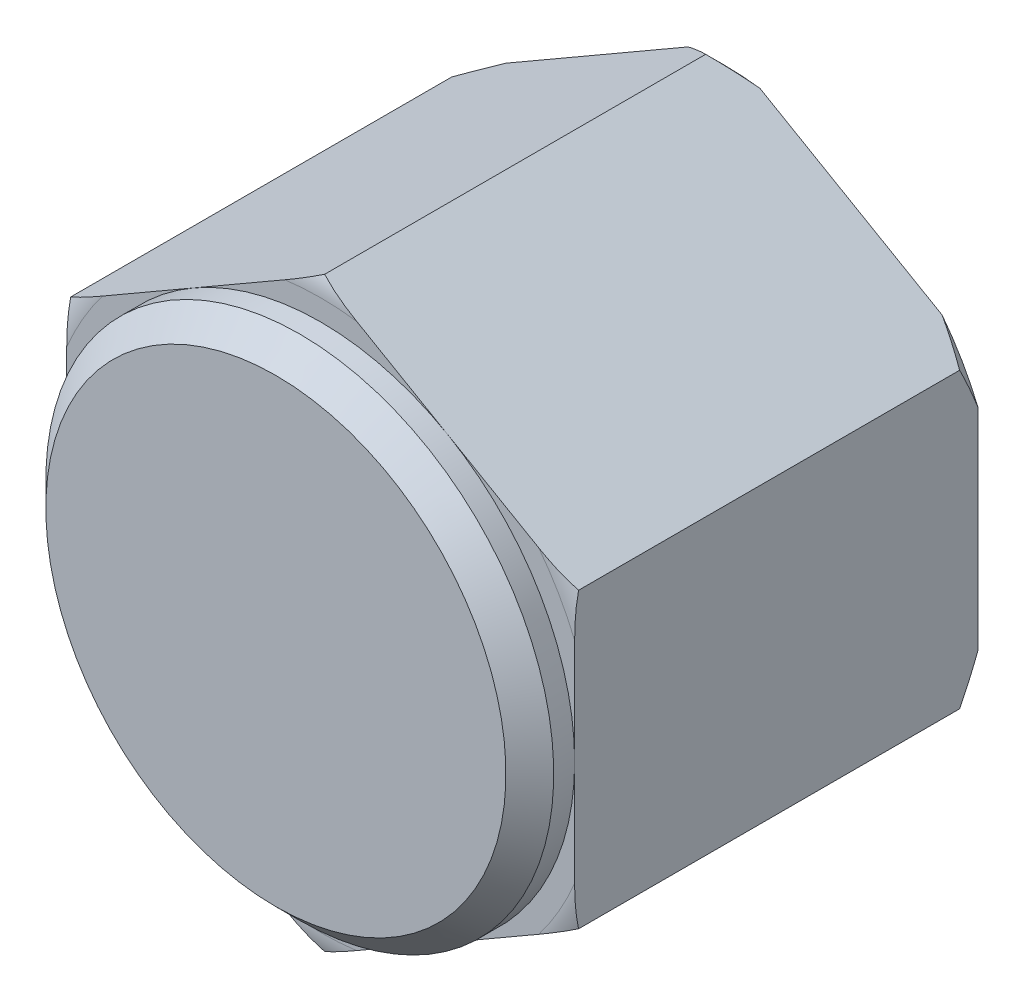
ISO-10303-21;
HEADER;
FILE_DESCRIPTION(('STEP AP214'),'2;1');
FILE_NAME('part.step','',(''),(''),'','','');
FILE_SCHEMA(('AUTOMOTIVE_DESIGN { 1 0 10303 214 1 1 1 1 }'));
ENDSEC;
DATA;
#1=APPLICATION_CONTEXT('core data for automotive mechanical design processes');
#2=APPLICATION_PROTOCOL_DEFINITION('international standard','automotive_design',2000,#1);
#3=PRODUCT_CONTEXT('',#1,'mechanical');
#4=PRODUCT('Part','Part','',(#3));
#5=PRODUCT_RELATED_PRODUCT_CATEGORY('part','',(#4));
#6=PRODUCT_DEFINITION_FORMATION('','',#4);
#7=PRODUCT_DEFINITION_CONTEXT('part definition',#1,'design');
#8=PRODUCT_DEFINITION('design','',#6,#7);
#9=PRODUCT_DEFINITION_SHAPE('','',#8);
#10=(LENGTH_UNIT() NAMED_UNIT(*) SI_UNIT(.MILLI.,.METRE.));
#11=(NAMED_UNIT(*) PLANE_ANGLE_UNIT() SI_UNIT($,.RADIAN.));
#12=(NAMED_UNIT(*) SI_UNIT($,.STERADIAN.) SOLID_ANGLE_UNIT());
#13=UNCERTAINTY_MEASURE_WITH_UNIT(LENGTH_MEASURE(1.E-05),#10,'distance_accuracy_value','');
#14=(GEOMETRIC_REPRESENTATION_CONTEXT(3) GLOBAL_UNCERTAINTY_ASSIGNED_CONTEXT((#13)) GLOBAL_UNIT_ASSIGNED_CONTEXT((#10,
#11,#12)) REPRESENTATION_CONTEXT('',''));
#15=CARTESIAN_POINT('',(0.,0.,0.));
#16=DIRECTION('',(0.,0.,1.));
#17=DIRECTION('',(1.,0.,0.));
#18=AXIS2_PLACEMENT_3D('',#15,#16,#17);
#19=CARTESIAN_POINT('',(8.5,0.,13.5));
#20=DIRECTION('',(0.,0.,1.));
#21=DIRECTION('',(0.,-1.,0.));
#22=AXIS2_PLACEMENT_3D('',#19,#20,#21);
#23=PLANE('',#22);
#24=DIRECTION('',(0.86602540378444,0.5,0.));
#25=VECTOR('',#24,1.);
#26=CARTESIAN_POINT('',(2.12500000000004,11.0418238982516,13.5));
#27=LINE('',#26,#25);
#28=CARTESIAN_POINT('',(-7.29836021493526,5.60124434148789,13.5));
#29=VERTEX_POINT('',#28);
#30=CARTESIAN_POINT('',(-4.25,7.36121593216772,13.5));
#31=VERTEX_POINT('',#30);
#32=EDGE_CURVE('E183',#29,#31,#27,.T.);
#33=ORIENTED_EDGE('',*,*,#32,.F.);
#34=CARTESIAN_POINT('',(0.,0.,13.5));
#35=DIRECTION('',(0.,0.,-1.));
#36=DIRECTION('',(0.,1.,0.));
#37=AXIS2_PLACEMENT_3D('',#34,#35,#36);
#38=CIRCLE('',#37,9.2);
#39=CARTESIAN_POINT('',(-8.5,3.51994318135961,13.5));
#40=VERTEX_POINT('',#39);
#41=EDGE_CURVE('E192',#40,#29,#38,.T.);
#42=ORIENTED_EDGE('',*,*,#41,.F.);
#43=DIRECTION('',(0.,1.,0.));
#44=VECTOR('',#43,1.);
#45=CARTESIAN_POINT('',(-8.5,0.,13.5));
#46=LINE('',#45,#44);
#47=CARTESIAN_POINT('',(-8.5,0.,13.5));
#48=VERTEX_POINT('',#47);
#49=EDGE_CURVE('E377',#48,#40,#46,.T.);
#50=ORIENTED_EDGE('',*,*,#49,.F.);
#51=CARTESIAN_POINT('',(0.,0.,13.5));
#52=DIRECTION('',(0.,0.,-1.));
#53=DIRECTION('',(0.,1.,0.));
#54=AXIS2_PLACEMENT_3D('',#51,#52,#53);
#55=CIRCLE('',#54,8.5);
#56=EDGE_CURVE('E403',#48,#31,#55,.T.);
#57=ORIENTED_EDGE('',*,*,#56,.T.);
#58=EDGE_LOOP('',(#33,#42,#50,#57));
#59=FACE_BOUND('',#58,.T.);
#60=ADVANCED_FACE('F14',(#59),#23,.T.);
#61=CARTESIAN_POINT('',(-8.5,-3.51994318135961,13.5));
#62=VERTEX_POINT('',#61);
#63=EDGE_CURVE('E379',#62,#48,#46,.T.);
#64=ORIENTED_EDGE('',*,*,#63,.F.);
#65=CARTESIAN_POINT('',(-7.29836021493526,-5.60124434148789,13.5));
#66=VERTEX_POINT('',#65);
#67=EDGE_CURVE('E355',#66,#62,#38,.T.);
#68=ORIENTED_EDGE('',*,*,#67,.F.);
#69=DIRECTION('',(-0.86602540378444,0.5,0.));
#70=VECTOR('',#69,1.);
#71=CARTESIAN_POINT('',(2.12500000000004,-11.0418238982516,13.5));
#72=LINE('',#71,#70);
#73=CARTESIAN_POINT('',(-4.25,-7.36121593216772,13.5));
#74=VERTEX_POINT('',#73);
#75=EDGE_CURVE('E230',#74,#66,#72,.T.);
#76=ORIENTED_EDGE('',*,*,#75,.F.);
#77=EDGE_CURVE('E394',#74,#48,#55,.T.);
#78=ORIENTED_EDGE('',*,*,#77,.T.);
#79=EDGE_LOOP('',(#64,#68,#76,#78));
#80=FACE_BOUND('',#79,.T.);
#81=ADVANCED_FACE('F391',(#80),#23,.T.);
#82=CARTESIAN_POINT('',(-1.20163978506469,-9.12118752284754,13.5));
#83=VERTEX_POINT('',#82);
#84=EDGE_CURVE('E219',#83,#74,#72,.T.);
#85=ORIENTED_EDGE('',*,*,#84,.F.);
#86=CARTESIAN_POINT('',(1.20163978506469,-9.12118752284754,13.5));
#87=VERTEX_POINT('',#86);
#88=EDGE_CURVE('E351',#87,#83,#38,.T.);
#89=ORIENTED_EDGE('',*,*,#88,.F.);
#90=DIRECTION('',(-0.86602540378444,-0.5,0.));
#91=VECTOR('',#90,1.);
#92=CARTESIAN_POINT('',(10.625,-3.68060796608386,13.5));
#93=LINE('',#92,#91);
#94=CARTESIAN_POINT('',(4.25,-7.36121593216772,13.5));
#95=VERTEX_POINT('',#94);
#96=EDGE_CURVE('E323',#95,#87,#93,.T.);
#97=ORIENTED_EDGE('',*,*,#96,.F.);
#98=EDGE_CURVE('E449',#95,#74,#55,.T.);
#99=ORIENTED_EDGE('',*,*,#98,.T.);
#100=EDGE_LOOP('',(#85,#89,#97,#99));
#101=FACE_BOUND('',#100,.T.);
#102=ADVANCED_FACE('F478',(#101),#23,.T.);
#103=CARTESIAN_POINT('',(7.29836021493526,-5.60124434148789,13.5));
#104=VERTEX_POINT('',#103);
#105=EDGE_CURVE('E324',#104,#95,#93,.T.);
#106=ORIENTED_EDGE('',*,*,#105,.F.);
#107=CARTESIAN_POINT('',(8.5,-3.51994318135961,13.5));
#108=VERTEX_POINT('',#107);
#109=EDGE_CURVE('E346',#108,#104,#38,.T.);
#110=ORIENTED_EDGE('',*,*,#109,.F.);
#111=DIRECTION('',(0.,-1.,0.));
#112=VECTOR('',#111,1.);
#113=CARTESIAN_POINT('',(8.5,0.,13.5));
#114=LINE('',#113,#112);
#115=CARTESIAN_POINT('',(8.5,0.,13.5));
#116=VERTEX_POINT('',#115);
#117=EDGE_CURVE('E442',#116,#108,#114,.T.);
#118=ORIENTED_EDGE('',*,*,#117,.F.);
#119=EDGE_CURVE('E348',#116,#95,#55,.T.);
#120=ORIENTED_EDGE('',*,*,#119,.T.);
#121=EDGE_LOOP('',(#106,#110,#118,#120));
#122=FACE_BOUND('',#121,.T.);
#123=ADVANCED_FACE('F344',(#122),#23,.T.);
#124=CARTESIAN_POINT('',(8.5,3.51994318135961,13.5));
#125=VERTEX_POINT('',#124);
#126=EDGE_CURVE('E443',#125,#116,#114,.T.);
#127=ORIENTED_EDGE('',*,*,#126,.F.);
#128=CARTESIAN_POINT('',(7.29836021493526,5.60124434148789,13.5));
#129=VERTEX_POINT('',#128);
#130=EDGE_CURVE('E193',#129,#125,#38,.T.);
#131=ORIENTED_EDGE('',*,*,#130,.F.);
#132=DIRECTION('',(0.86602540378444,-0.5,0.));
#133=VECTOR('',#132,1.);
#134=CARTESIAN_POINT('',(10.625,3.68060796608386,13.5));
#135=LINE('',#134,#133);
#136=CARTESIAN_POINT('',(4.25,7.36121593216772,13.5));
#137=VERTEX_POINT('',#136);
#138=EDGE_CURVE('E29',#137,#129,#135,.T.);
#139=ORIENTED_EDGE('',*,*,#138,.F.);
#140=EDGE_CURVE('E357',#137,#116,#55,.T.);
#141=ORIENTED_EDGE('',*,*,#140,.T.);
#142=EDGE_LOOP('',(#127,#131,#139,#141));
#143=FACE_BOUND('',#142,.T.);
#144=ADVANCED_FACE('F451',(#143),#23,.T.);
#145=CARTESIAN_POINT('',(0.,0.,12.0000000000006));
#146=DIRECTION('',(0.,0.,-1.));
#147=DIRECTION('',(0.,1.,0.));
#148=AXIS2_PLACEMENT_3D('',#145,#146,#147);
#149=TOROIDAL_SURFACE('',#148,9.20000000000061,1.49999999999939);
#150=CARTESIAN_POINT('',(-8.50019999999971,4.90736181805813,13.3680967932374));
#151=CARTESIAN_POINT('',(-8.42243016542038,4.95226225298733,13.3882564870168));
#152=CARTESIAN_POINT('',(-8.34414521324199,4.99746009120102,13.4055341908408));
#153=CARTESIAN_POINT('',(-8.18693798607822,5.08822372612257,13.4350729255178));
#154=CARTESIAN_POINT('',(-8.10801638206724,5.13378913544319,13.4473386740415));
#155=CARTESIAN_POINT('',(-7.95029515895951,5.22484952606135,13.4675699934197));
#156=CARTESIAN_POINT('',(-7.87149808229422,5.27034303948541,13.4755630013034));
#157=CARTESIAN_POINT('',(-7.71367937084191,5.36145971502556,13.4879940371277));
#158=CARTESIAN_POINT('',(-7.63465768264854,5.40708290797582,13.4924311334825));
#159=CARTESIAN_POINT('',(-7.3976432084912,5.5439232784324,13.5012598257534));
#160=CARTESIAN_POINT('',(-7.23952867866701,5.63521074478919,13.5011882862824));
#161=CARTESIAN_POINT('',(-6.92320610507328,5.81783966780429,13.4930497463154));
#162=CARTESIAN_POINT('',(-6.76499849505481,5.9091808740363,13.4849669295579));
#163=CARTESIAN_POINT('',(-6.46907097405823,6.0800347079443,13.4655374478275));
#164=CARTESIAN_POINT('',(-6.33132180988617,6.15956422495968,13.4547412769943));
#165=CARTESIAN_POINT('',(-6.05590953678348,6.31857357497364,13.4317511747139));
#166=CARTESIAN_POINT('',(-5.91824643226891,6.39805340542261,13.4195571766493));
#167=CARTESIAN_POINT('',(-5.64291116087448,6.55701829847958,13.3957321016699));
#168=CARTESIAN_POINT('',(-5.50523900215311,6.63650335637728,13.3841009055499));
#169=CARTESIAN_POINT('',(-5.22976250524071,6.79554978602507,13.3631584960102));
#170=CARTESIAN_POINT('',(-5.0919581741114,6.87511115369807,13.3538471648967));
#171=CARTESIAN_POINT('',(-4.81616511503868,7.03434035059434,13.3389591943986));
#172=CARTESIAN_POINT('',(-4.67817635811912,7.11400819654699,13.3333832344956));
#173=CARTESIAN_POINT('',(-4.40211633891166,7.27339152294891,13.3268398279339));
#174=CARTESIAN_POINT('',(-4.26404507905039,7.35310700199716,13.3258722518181));
#175=CARTESIAN_POINT('',(-3.98785640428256,7.51256460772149,13.3286997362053));
#176=CARTESIAN_POINT('',(-3.84973901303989,7.59230672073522,13.3324977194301));
#177=CARTESIAN_POINT('',(-3.57363628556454,7.7517147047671,13.3442625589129));
#178=CARTESIAN_POINT('',(-3.43565095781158,7.83138057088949,13.3522296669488));
#179=CARTESIAN_POINT('',(-3.1606880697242,7.99013046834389,13.3710481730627));
#180=CARTESIAN_POINT('',(-3.02370953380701,8.06921506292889,13.3818815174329));
#181=CARTESIAN_POINT('',(-2.74984480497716,8.22733093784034,13.4048362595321));
#182=CARTESIAN_POINT('',(-2.61295860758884,8.30636222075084,13.4169575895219));
#183=CARTESIAN_POINT('',(-2.33939693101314,8.46430312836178,13.44061012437));
#184=CARTESIAN_POINT('',(-2.20272152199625,8.54321271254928,13.4521423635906));
#185=CARTESIAN_POINT('',(-1.92918036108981,8.70114177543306,13.4726481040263));
#186=CARTESIAN_POINT('',(-1.79231456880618,8.78016127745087,13.4816209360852));
#187=CARTESIAN_POINT('',(-1.51748246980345,8.93883566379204,13.4949086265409));
#188=CARTESIAN_POINT('',(-1.37951491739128,9.01849126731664,13.4991919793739));
#189=CARTESIAN_POINT('',(-1.10362233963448,9.17777792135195,13.5006028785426));
#190=CARTESIAN_POINT('',(-0.965697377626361,9.25740893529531,13.4977364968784));
#191=CARTESIAN_POINT('',(-0.758517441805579,9.37702432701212,13.48598520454));
#192=CARTESIAN_POINT('',(-0.689105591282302,9.41709927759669,13.4807869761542));
#193=CARTESIAN_POINT('',(-0.550501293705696,9.49712250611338,13.4674663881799));
#194=CARTESIAN_POINT('',(-0.481308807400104,9.53707080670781,13.4593445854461));
#195=CARTESIAN_POINT('',(-0.343063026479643,9.61688704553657,13.4397060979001));
#196=CARTESIAN_POINT('',(-0.274010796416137,9.65675436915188,13.4281791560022));
#197=CARTESIAN_POINT('',(-0.136437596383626,9.73618229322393,13.4012082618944));
#198=CARTESIAN_POINT('',(-0.0679170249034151,9.77574266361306,13.3857616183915));
#199=CARTESIAN_POINT('',(0.000200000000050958,9.81507004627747,13.3680967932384));
#200=B_SPLINE_CURVE_WITH_KNOTS('',3,(#150,#151,#152,#153,#154,#155,#156,#157,#158,#159,#160,
#161,#162,#163,#164,#165,#166,#167,#168,#169,#170,#171,#172,#173,#174,#175,#176,#177,#178,#179,
#180,#181,#182,#183,#184,#185,#186,#187,#188,#189,#190,#191,#192,#193,#194,#195,#196,#197,#198,
#199),.UNSPECIFIED.,.F.,.F.,(4,2,2,2,2,2,2,2,2,2,2,2,2,2,2,2,2,2,2,2,2,2,2,2,4),(0.,
0.27598715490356,0.551713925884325,0.825648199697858,1.09965421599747,1.64706775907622,
2.1955641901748,2.6738229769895,3.15210456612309,3.63028440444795,4.108439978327,
4.58668250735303,5.06491160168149,5.54343413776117,6.02198557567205,6.49759167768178,
6.97317277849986,7.44788789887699,7.92272701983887,8.40073706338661,8.87834128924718,
9.11925238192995,9.3601176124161,9.60171591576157,9.84348055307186),.UNSPECIFIED.);
#201=CARTESIAN_POINT('',(-8.5,4.9074772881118,13.3681487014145));
#202=VERTEX_POINT('',#201);
#203=EDGE_CURVE('E179',#202,#29,#200,.T.);
#204=ORIENTED_EDGE('',*,*,#203,.F.);
#205=CARTESIAN_POINT('',(-8.5,0.,13.3266499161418));
#206=CARTESIAN_POINT('',(-8.5,0.125047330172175,13.3266437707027));
#207=CARTESIAN_POINT('',(-8.5,0.250092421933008,13.3281163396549));
#208=CARTESIAN_POINT('',(-8.5,0.500119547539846,13.3338478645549));
#209=CARTESIAN_POINT('',(-8.5,0.62510158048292,13.338106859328));
#210=CARTESIAN_POINT('',(-8.5,0.875005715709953,13.3490101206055));
#211=CARTESIAN_POINT('',(-8.5,0.999927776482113,13.355655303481));
#212=CARTESIAN_POINT('',(-8.5,1.24966826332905,13.3706958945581));
#213=CARTESIAN_POINT('',(-8.5,1.37448668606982,13.3790913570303));
#214=CARTESIAN_POINT('',(-8.5,1.74936920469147,13.4057855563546));
#215=CARTESIAN_POINT('',(-8.5,1.99931804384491,13.4255620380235));
#216=CARTESIAN_POINT('',(-8.5,2.49942057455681,13.4616637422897));
#217=CARTESIAN_POINT('',(-8.5,2.74957414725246,13.4779903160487));
#218=CARTESIAN_POINT('',(-8.5,3.125574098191,13.4936320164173));
#219=CARTESIAN_POINT('',(-8.5,3.25121665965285,13.4973702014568));
#220=CARTESIAN_POINT('',(-8.5,3.50255169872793,13.500701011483));
#221=CARTESIAN_POINT('',(-8.5,3.62824416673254,13.5002942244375));
#222=CARTESIAN_POINT('',(-8.5,3.87949943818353,13.4940558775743));
#223=CARTESIAN_POINT('',(-8.5,4.00506225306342,13.4882248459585));
#224=CARTESIAN_POINT('',(-8.5,4.2556767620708,13.4696816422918));
#225=CARTESIAN_POINT('',(-8.5,4.380728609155,13.4569717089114));
#226=CARTESIAN_POINT('',(-8.5,4.593208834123,13.4279371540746));
#227=CARTESIAN_POINT('',(-8.5,4.68092863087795,13.4137617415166));
#228=CARTESIAN_POINT('',(-8.5,4.85540226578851,13.3803995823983));
#229=CARTESIAN_POINT('',(-8.5,4.94215637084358,13.3612142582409));
#230=CARTESIAN_POINT('',(-8.5,5.11404821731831,13.3170447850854));
#231=CARTESIAN_POINT('',(-8.5,5.19918836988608,13.2920701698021));
#232=CARTESIAN_POINT('',(-8.5,5.36715872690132,13.2353680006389));
#233=CARTESIAN_POINT('',(-8.5,5.44999046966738,13.2036450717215));
#234=CARTESIAN_POINT('',(-8.5,5.61941349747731,13.1291884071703));
#235=CARTESIAN_POINT('',(-8.5,5.7056926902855,13.0857306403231));
#236=CARTESIAN_POINT('',(-8.5,5.87192631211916,12.9878941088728));
#237=CARTESIAN_POINT('',(-8.5,5.95188525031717,12.9335232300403));
#238=CARTESIAN_POINT('',(-8.5,6.08581680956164,12.8252682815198));
#239=CARTESIAN_POINT('',(-8.5,6.14169180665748,12.7737613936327));
#240=CARTESIAN_POINT('',(-8.5,6.24464781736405,12.6625582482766));
#241=CARTESIAN_POINT('',(-8.5,6.2917436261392,12.6028760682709));
#242=CARTESIAN_POINT('',(-8.5,6.36390910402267,12.4909658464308));
#243=CARTESIAN_POINT('',(-8.5,6.39155175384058,12.4404060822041));
#244=CARTESIAN_POINT('',(-8.5,6.43819940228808,12.3354209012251));
#245=CARTESIAN_POINT('',(-8.5,6.45721080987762,12.2809983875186));
#246=CARTESIAN_POINT('',(-8.5,6.48524460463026,12.1691993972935));
#247=CARTESIAN_POINT('',(-8.5,6.49419819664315,12.1118053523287));
#248=CARTESIAN_POINT('',(-8.5,6.50105152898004,11.9963619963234));
#249=CARTESIAN_POINT('',(-8.5,6.49895516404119,11.9383129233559));
#250=CARTESIAN_POINT('',(-8.5,6.4847137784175,11.8296430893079));
#251=CARTESIAN_POINT('',(-8.5,6.47363571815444,11.778877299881));
#252=CARTESIAN_POINT('',(-8.5,6.44358285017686,11.6797604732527));
#253=CARTESIAN_POINT('',(-8.5,6.42460542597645,11.6314102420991));
#254=CARTESIAN_POINT('',(-8.5,6.37286476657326,11.5233802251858));
#255=CARTESIAN_POINT('',(-8.5,6.3376470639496,11.4648783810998));
#256=CARTESIAN_POINT('',(-8.5,6.25819781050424,11.3543704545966));
#257=CARTESIAN_POINT('',(-8.5,6.21394958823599,11.3023766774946));
#258=CARTESIAN_POINT('',(-8.5,6.09738498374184,11.1830439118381));
#259=CARTESIAN_POINT('',(-8.5,6.02139388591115,11.119316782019));
#260=CARTESIAN_POINT('',(-8.5,5.86054997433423,11.004336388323));
#261=CARTESIAN_POINT('',(-8.5,5.77567843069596,10.9531102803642));
#262=CARTESIAN_POINT('',(-8.5,5.61377586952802,10.8684424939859));
#263=CARTESIAN_POINT('',(-8.5,5.53752226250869,10.833480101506));
#264=CARTESIAN_POINT('',(-8.5,5.38224383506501,10.7702643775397));
#265=CARTESIAN_POINT('',(-8.5,5.30321682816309,10.7420164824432));
#266=CARTESIAN_POINT('',(-8.5,5.14327407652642,10.6913419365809));
#267=CARTESIAN_POINT('',(-8.5,5.06235685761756,10.6689200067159));
#268=CARTESIAN_POINT('',(-8.5,4.89935774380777,10.6291605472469));
#269=CARTESIAN_POINT('',(-8.5,4.81727661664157,10.6118198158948));
#270=CARTESIAN_POINT('',(-8.5,4.57529845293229,10.5673574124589));
#271=CARTESIAN_POINT('',(-8.5,4.41430000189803,10.54622005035));
#272=CARTESIAN_POINT('',(-8.5,4.09111681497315,10.5162439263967));
#273=CARTESIAN_POINT('',(-8.5,3.9289309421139,10.5074191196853));
#274=CARTESIAN_POINT('',(-8.5,3.6036636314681,10.4988655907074));
#275=CARTESIAN_POINT('',(-8.5,3.44058134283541,10.4991761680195));
#276=CARTESIAN_POINT('',(-8.5,3.1146561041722,10.5062241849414));
#277=CARTESIAN_POINT('',(-8.5,2.95181308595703,10.5129591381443));
#278=CARTESIAN_POINT('',(-8.5,2.625127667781,10.5304671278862));
#279=CARTESIAN_POINT('',(-8.5,2.46128702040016,10.541270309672));
#280=CARTESIAN_POINT('',(-8.5,2.13372641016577,10.5645990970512));
#281=CARTESIAN_POINT('',(-8.5,1.97000645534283,10.5771248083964));
#282=CARTESIAN_POINT('',(-8.5,1.64297146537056,10.6017111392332));
#283=CARTESIAN_POINT('',(-8.5,1.47965652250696,10.6137729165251));
#284=CARTESIAN_POINT('',(-8.5,1.1528712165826,10.6355388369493));
#285=CARTESIAN_POINT('',(-8.5,0.989400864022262,10.6452431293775));
#286=CARTESIAN_POINT('',(-8.5,0.665741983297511,10.6605758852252));
#287=CARTESIAN_POINT('',(-8.5,0.505557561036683,10.6662866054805));
#288=CARTESIAN_POINT('',(-8.5,0.185088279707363,10.673061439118));
#289=CARTESIAN_POINT('',(-8.5,0.0248034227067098,10.674125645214));
#290=CARTESIAN_POINT('',(-8.5,-0.295873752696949,10.6714354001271));
#291=CARTESIAN_POINT('',(-8.5,-0.456266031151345,10.6676764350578));
#292=CARTESIAN_POINT('',(-8.5,-0.776892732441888,10.6559317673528));
#293=CARTESIAN_POINT('',(-8.5,-0.937127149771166,10.6479459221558));
#294=CARTESIAN_POINT('',(-8.5,-1.25758599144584,10.6289802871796));
#295=CARTESIAN_POINT('',(-8.5,-1.41781021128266,10.6179972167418));
#296=CARTESIAN_POINT('',(-8.5,-1.73816473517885,10.594722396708));
#297=CARTESIAN_POINT('',(-8.5,-1.89829503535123,10.5824305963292));
#298=CARTESIAN_POINT('',(-8.5,-2.21852763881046,10.5584782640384));
#299=CARTESIAN_POINT('',(-8.5,-2.37862991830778,10.5468174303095));
#300=CARTESIAN_POINT('',(-8.5,-2.6990027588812,10.5262086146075));
#301=CARTESIAN_POINT('',(-8.5,-2.85927329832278,10.5172603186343));
#302=CARTESIAN_POINT('',(-8.5,-3.1808827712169,10.5042779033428));
#303=CARTESIAN_POINT('',(-8.5,-3.34222288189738,10.5002699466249));
#304=CARTESIAN_POINT('',(-8.5,-3.66505319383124,10.4997558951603));
#305=CARTESIAN_POINT('',(-8.5,-3.82654342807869,10.5032541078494));
#306=CARTESIAN_POINT('',(-8.5,-4.14856635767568,10.5206182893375));
#307=CARTESIAN_POINT('',(-8.5,-4.30910046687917,10.5344554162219));
#308=CARTESIAN_POINT('',(-8.5,-4.62835196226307,10.5759002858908));
#309=CARTESIAN_POINT('',(-8.5,-4.78707139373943,10.6034905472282));
#310=CARTESIAN_POINT('',(-8.5,-5.02283306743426,10.6586867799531));
#311=CARTESIAN_POINT('',(-8.5,-5.10145968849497,10.6795407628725));
#312=CARTESIAN_POINT('',(-8.5,-5.25708187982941,10.7265937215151));
#313=CARTESIAN_POINT('',(-8.5,-5.3340782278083,10.7527900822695));
#314=CARTESIAN_POINT('',(-8.5,-5.48546792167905,10.8112258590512));
#315=CARTESIAN_POINT('',(-8.5,-5.55986930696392,10.8434441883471));
#316=CARTESIAN_POINT('',(-8.5,-5.70520821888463,10.9148464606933));
#317=CARTESIAN_POINT('',(-8.5,-5.77614936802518,10.954022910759));
#318=CARTESIAN_POINT('',(-8.5,-5.90866398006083,11.0375400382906));
#319=CARTESIAN_POINT('',(-8.5,-5.97054654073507,11.0813839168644));
#320=CARTESIAN_POINT('',(-8.5,-6.08819372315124,11.1768370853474));
#321=CARTESIAN_POINT('',(-8.5,-6.14395374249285,11.2284521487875));
#322=CARTESIAN_POINT('',(-8.5,-6.24738381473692,11.3406388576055));
#323=CARTESIAN_POINT('',(-8.5,-6.29493941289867,11.4013181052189));
#324=CARTESIAN_POINT('',(-8.5,-6.37737944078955,11.5307461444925));
#325=CARTESIAN_POINT('',(-8.5,-6.41230192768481,11.5994698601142));
#326=CARTESIAN_POINT('',(-8.5,-6.45741080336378,11.7206871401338));
#327=CARTESIAN_POINT('',(-8.5,-6.47191209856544,11.7715837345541));
#328=CARTESIAN_POINT('',(-8.5,-6.49214767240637,11.8750980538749));
#329=CARTESIAN_POINT('',(-8.5,-6.49788756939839,11.9277146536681));
#330=CARTESIAN_POINT('',(-8.5,-6.50015521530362,12.033224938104));
#331=CARTESIAN_POINT('',(-8.5,-6.49666922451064,12.0861189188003));
#332=CARTESIAN_POINT('',(-8.5,-6.48073543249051,12.1905348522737));
#333=CARTESIAN_POINT('',(-8.5,-6.46828463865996,12.2420563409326));
#334=CARTESIAN_POINT('',(-8.5,-6.43547348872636,12.3419388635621));
#335=CARTESIAN_POINT('',(-8.5,-6.41518858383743,12.3903250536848));
#336=CARTESIAN_POINT('',(-8.5,-6.36789906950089,12.4836609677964));
#337=CARTESIAN_POINT('',(-8.5,-6.34089164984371,12.5286092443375));
#338=CARTESIAN_POINT('',(-8.5,-6.26568501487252,12.6373682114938));
#339=CARTESIAN_POINT('',(-8.5,-6.21381646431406,12.6986438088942));
#340=CARTESIAN_POINT('',(-8.5,-6.10102119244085,12.8121928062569));
#341=CARTESIAN_POINT('',(-8.5,-6.04007197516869,12.8644431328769));
#342=CARTESIAN_POINT('',(-8.5,-5.87621595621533,12.9874037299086));
#343=CARTESIAN_POINT('',(-8.5,-5.76886799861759,13.0521552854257));
#344=CARTESIAN_POINT('',(-8.5,-5.54579886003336,13.1648515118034));
#345=CARTESIAN_POINT('',(-8.5,-5.43005994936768,13.2127592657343));
#346=CARTESIAN_POINT('',(-8.5,-5.20255386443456,13.291920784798));
#347=CARTESIAN_POINT('',(-8.5,-5.09111165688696,13.3241335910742));
#348=CARTESIAN_POINT('',(-8.5,-4.86584173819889,13.3789457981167));
#349=CARTESIAN_POINT('',(-8.5,-4.75201192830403,13.4015363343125));
#350=CARTESIAN_POINT('',(-8.5,-4.52291113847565,13.4388385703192));
#351=CARTESIAN_POINT('',(-8.5,-4.40763805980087,13.4535369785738));
#352=CARTESIAN_POINT('',(-8.5,-4.17651270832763,13.4764460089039));
#353=CARTESIAN_POINT('',(-8.5,-4.06066063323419,13.4846587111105));
#354=CARTESIAN_POINT('',(-8.5,-3.81083580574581,13.4967080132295));
#355=CARTESIAN_POINT('',(-8.5,-3.67682360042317,13.4996745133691));
#356=CARTESIAN_POINT('',(-8.5,-3.40878977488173,13.5002741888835));
#357=CARTESIAN_POINT('',(-8.5,-3.27476815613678,13.4979065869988));
#358=CARTESIAN_POINT('',(-8.5,-2.87309197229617,13.485029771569));
#359=CARTESIAN_POINT('',(-8.5,-2.60564928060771,13.4687510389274));
#360=CARTESIAN_POINT('',(-8.5,-2.1435275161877,13.4362561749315));
#361=CARTESIAN_POINT('',(-8.5,-1.94874188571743,13.421215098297));
#362=CARTESIAN_POINT('',(-8.5,-1.55907278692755,13.3920591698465));
#363=CARTESIAN_POINT('',(-8.5,-1.36418931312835,13.3779443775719));
#364=CARTESIAN_POINT('',(-8.5,-0.974519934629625,13.3538473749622));
#365=CARTESIAN_POINT('',(-8.5,-0.779734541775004,13.3438574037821));
#366=CARTESIAN_POINT('',(-8.5,-0.389964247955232,13.330264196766));
#367=CARTESIAN_POINT('',(-8.5,-0.194979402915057,13.3266594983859));
#368=CARTESIAN_POINT('',(-8.5,0.,13.3266499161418));
#369=B_SPLINE_CURVE_WITH_KNOTS('',3,(#205,#206,#207,#208,#209,#210,#211,#212,#213,#214,#215,
#216,#217,#218,#219,#220,#221,#222,#223,#224,#225,#226,#227,#228,#229,#230,#231,#232,#233,#234,
#235,#236,#237,#238,#239,#240,#241,#242,#243,#244,#245,#246,#247,#248,#249,#250,#251,#252,#253,
#254,#255,#256,#257,#258,#259,#260,#261,#262,#263,#264,#265,#266,#267,#268,#269,#270,#271,#272,
#273,#274,#275,#276,#277,#278,#279,#280,#281,#282,#283,#284,#285,#286,#287,#288,#289,#290,#291,
#292,#293,#294,#295,#296,#297,#298,#299,#300,#301,#302,#303,#304,#305,#306,#307,#308,#309,#310,
#311,#312,#313,#314,#315,#316,#317,#318,#319,#320,#321,#322,#323,#324,#325,#326,#327,#328,#329,
#330,#331,#332,#333,#334,#335,#336,#337,#338,#339,#340,#341,#342,#343,#344,#345,#346,#347,#348,
#349,#350,#351,#352,#353,#354,#355,#356,#357,#358,#359,#360,#361,#362,#363,#364,#365,#366,#367,
#368),.UNSPECIFIED.,.T.,.F.,(4,2,2,2,2,2,2,2,2,2,2,2,2,2,2,2,2,2,2,2,2,2,2,2,2,2,2,2,2,2,2,2,2,
2,2,2,2,2,2,2,2,2,2,2,2,2,2,2,2,2,2,2,2,2,2,2,2,2,2,2,2,2,2,2,2,2,2,2,2,2,2,2,2,2,2,2,2,2,2,2,2,
4),(0.,0.375130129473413,0.750265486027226,1.12554506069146,1.50083627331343,2.2530483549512,
3.00496528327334,3.38200818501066,3.7589976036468,4.13595031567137,4.51278042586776,
4.77923439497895,5.04561279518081,5.31155560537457,5.57731673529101,5.86650123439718,
6.15547751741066,6.38272217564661,6.60958033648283,6.78178352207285,6.95385863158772,
7.12710369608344,7.30028770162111,7.45547335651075,7.61071045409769,7.81443221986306,
8.01853353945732,8.31440554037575,8.61091465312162,8.86221768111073,9.11372348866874,
9.36543246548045,9.61698249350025,10.1033958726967,10.5903601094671,11.0794195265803,
11.5682897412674,12.0608560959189,12.5534527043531,13.0447275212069,13.5359712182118,
14.0167722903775,14.4975637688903,14.9788055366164,15.4600635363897,15.9418504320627,
16.4236560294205,16.9052290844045,17.3867463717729,17.8708028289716,18.3551371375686,
18.8381253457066,19.3205011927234,19.5643851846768,19.8081500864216,20.0510768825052,
20.2937436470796,20.5207412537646,20.747908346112,20.9780253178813,21.207443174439,
21.3655335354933,21.5235224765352,21.681746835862,21.8400240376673,21.9968134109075,
22.1536684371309,22.393142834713,22.633220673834,23.0072046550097,23.3820032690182,
23.7294958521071,24.0773078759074,24.4257038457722,24.7739880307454,25.1759789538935,
25.5780284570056,26.3815979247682,26.9677219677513,27.5538836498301,28.1389373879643,
28.7238571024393),.UNSPECIFIED.);
#370=EDGE_CURVE('E378',#40,#202,#369,.T.);
#371=ORIENTED_EDGE('',*,*,#370,.F.);
#372=ORIENTED_EDGE('',*,*,#41,.T.);
#373=EDGE_LOOP('',(#204,#371,#372));
#374=FACE_BOUND('',#373,.T.);
#375=ADVANCED_FACE('F276',(#374),#149,.T.);
#376=CARTESIAN_POINT('',(-8.5,-4.9074772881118,13.3681487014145));
#377=VERTEX_POINT('',#376);
#378=EDGE_CURVE('E218',#377,#62,#369,.T.);
#379=ORIENTED_EDGE('',*,*,#378,.F.);
#380=CARTESIAN_POINT('',(0.0002,-9.81507004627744,13.3680967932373));
#381=CARTESIAN_POINT('',(-0.0775698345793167,-9.77016961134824,13.3882564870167));
#382=CARTESIAN_POINT('',(-0.155854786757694,-9.72497177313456,13.4055341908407));
#383=CARTESIAN_POINT('',(-0.313062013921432,-9.63420813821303,13.4350729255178));
#384=CARTESIAN_POINT('',(-0.391983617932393,-9.58864272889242,13.4473386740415));
#385=CARTESIAN_POINT('',(-0.549704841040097,-9.49758233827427,13.4675699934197));
#386=CARTESIAN_POINT('',(-0.62850191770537,-9.45208882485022,13.4755630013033));
#387=CARTESIAN_POINT('',(-0.786320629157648,-9.36097214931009,13.4879940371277));
#388=CARTESIAN_POINT('',(-0.865342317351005,-9.31534895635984,13.4924311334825));
#389=CARTESIAN_POINT('',(-1.1023567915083,-9.17850858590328,13.5012598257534));
#390=CARTESIAN_POINT('',(-1.26047132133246,-9.08722111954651,13.5011882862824));
#391=CARTESIAN_POINT('',(-1.57679389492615,-8.90459219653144,13.4930497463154));
#392=CARTESIAN_POINT('',(-1.73500150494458,-8.81325099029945,13.484966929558));
#393=CARTESIAN_POINT('',(-2.03092902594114,-8.64239715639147,13.4655374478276));
#394=CARTESIAN_POINT('',(-2.16867819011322,-8.56286763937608,13.4547412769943));
#395=CARTESIAN_POINT('',(-2.44409046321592,-8.40385828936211,13.431751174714));
#396=CARTESIAN_POINT('',(-2.58175356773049,-8.32437845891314,13.4195571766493));
#397=CARTESIAN_POINT('',(-2.85708883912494,-8.16541356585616,13.39573210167));
#398=CARTESIAN_POINT('',(-2.99476099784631,-8.08592850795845,13.38410090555));
#399=CARTESIAN_POINT('',(-3.27023749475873,-7.92688207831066,13.3631584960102));
#400=CARTESIAN_POINT('',(-3.40804182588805,-7.84732071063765,13.3538471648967));
#401=CARTESIAN_POINT('',(-3.68383488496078,-7.68809151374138,13.3389591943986));
#402=CARTESIAN_POINT('',(-3.82182364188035,-7.60842366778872,13.3333832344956));
#403=CARTESIAN_POINT('',(-4.09788366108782,-7.44904034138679,13.3268398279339));
#404=CARTESIAN_POINT('',(-4.2359549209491,-7.36932486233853,13.3258722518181));
#405=CARTESIAN_POINT('',(-4.51214359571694,-7.20986725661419,13.3286997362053));
#406=CARTESIAN_POINT('',(-4.65026098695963,-7.13012514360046,13.3324977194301));
#407=CARTESIAN_POINT('',(-4.92636371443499,-6.97071715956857,13.3442625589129));
#408=CARTESIAN_POINT('',(-5.06434904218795,-6.89105129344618,13.3522296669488));
#409=CARTESIAN_POINT('',(-5.33931193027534,-6.73230139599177,13.3710481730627));
#410=CARTESIAN_POINT('',(-5.47629046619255,-6.65321680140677,13.3818815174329));
#411=CARTESIAN_POINT('',(-5.7501551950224,-6.49510092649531,13.404836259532));
#412=CARTESIAN_POINT('',(-5.88704139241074,-6.41606964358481,13.4169575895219));
#413=CARTESIAN_POINT('',(-6.16060306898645,-6.25812873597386,13.4406101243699));
#414=CARTESIAN_POINT('',(-6.29727847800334,-6.17921915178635,13.4521423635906));
#415=CARTESIAN_POINT('',(-6.5708196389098,-6.02129008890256,13.4726481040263));
#416=CARTESIAN_POINT('',(-6.70768543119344,-5.94227058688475,13.4816209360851));
#417=CARTESIAN_POINT('',(-6.98251753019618,-5.78359620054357,13.4949086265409));
#418=CARTESIAN_POINT('',(-7.12048508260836,-5.70394059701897,13.4991919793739));
#419=CARTESIAN_POINT('',(-7.39637766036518,-5.54465394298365,13.5006028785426));
#420=CARTESIAN_POINT('',(-7.5343026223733,-5.46502292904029,13.4977364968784));
#421=CARTESIAN_POINT('',(-7.74148255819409,-5.34540753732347,13.48598520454));
#422=CARTESIAN_POINT('',(-7.81089440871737,-5.3053325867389,13.4807869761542));
#423=CARTESIAN_POINT('',(-7.94949870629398,-5.2253093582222,13.4674663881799));
#424=CARTESIAN_POINT('',(-8.01869119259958,-5.18536105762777,13.4593445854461));
#425=CARTESIAN_POINT('',(-8.15693697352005,-5.10554481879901,13.4397060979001));
#426=CARTESIAN_POINT('',(-8.22598920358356,-5.06567749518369,13.4281791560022));
#427=CARTESIAN_POINT('',(-8.36356240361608,-4.98624957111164,13.4012082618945));
#428=CARTESIAN_POINT('',(-8.4320829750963,-4.94668920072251,13.3857616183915));
#429=CARTESIAN_POINT('',(-8.50019999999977,-4.9073618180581,13.3680967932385));
#430=B_SPLINE_CURVE_WITH_KNOTS('',3,(#380,#381,#382,#383,#384,#385,#386,#387,#388,#389,#390,
#391,#392,#393,#394,#395,#396,#397,#398,#399,#400,#401,#402,#403,#404,#405,#406,#407,#408,#409,
#410,#411,#412,#413,#414,#415,#416,#417,#418,#419,#420,#421,#422,#423,#424,#425,#426,#427,#428,
#429),.UNSPECIFIED.,.F.,.F.,(4,2,2,2,2,2,2,2,2,2,2,2,2,2,2,2,2,2,2,2,2,2,2,2,4),(0.,
0.275987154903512,0.551713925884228,0.825648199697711,1.09965421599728,1.64706775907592,
2.19556419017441,2.67382297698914,3.15210456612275,3.63028440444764,4.10843997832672,
4.58668250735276,5.06491160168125,5.54343413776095,6.02198557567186,6.49759167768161,
6.97317277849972,7.44788789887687,7.92272701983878,8.40073706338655,8.87834128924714,
9.11925238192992,9.36011761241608,9.60171591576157,9.84348055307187),.UNSPECIFIED.);
#431=EDGE_CURVE('E221',#66,#377,#430,.T.);
#432=ORIENTED_EDGE('',*,*,#431,.F.);
#433=ORIENTED_EDGE('',*,*,#67,.T.);
#434=EDGE_LOOP('',(#379,#432,#433));
#435=FACE_BOUND('',#434,.T.);
#436=ADVANCED_FACE('F395',(#435),#149,.T.);
#437=CARTESIAN_POINT('',(0.,-9.8149545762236,13.3681487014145));
#438=VERTEX_POINT('',#437);
#439=EDGE_CURVE('E216',#438,#83,#430,.T.);
#440=ORIENTED_EDGE('',*,*,#439,.F.);
#441=CARTESIAN_POINT('',(8.50019999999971,-4.90736181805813,13.3680967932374));
#442=CARTESIAN_POINT('',(8.42243016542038,-4.95226225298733,13.3882564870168));
#443=CARTESIAN_POINT('',(8.34414521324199,-4.99746009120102,13.4055341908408));
#444=CARTESIAN_POINT('',(8.18693798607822,-5.08822372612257,13.4350729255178));
#445=CARTESIAN_POINT('',(8.10801638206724,-5.13378913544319,13.4473386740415));
#446=CARTESIAN_POINT('',(7.95029515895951,-5.22484952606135,13.4675699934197));
#447=CARTESIAN_POINT('',(7.87149808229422,-5.27034303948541,13.4755630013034));
#448=CARTESIAN_POINT('',(7.71367937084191,-5.36145971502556,13.4879940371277));
#449=CARTESIAN_POINT('',(7.63465768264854,-5.40708290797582,13.4924311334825));
#450=CARTESIAN_POINT('',(7.3976432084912,-5.5439232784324,13.5012598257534));
#451=CARTESIAN_POINT('',(7.23952867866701,-5.63521074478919,13.5011882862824));
#452=CARTESIAN_POINT('',(6.92320610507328,-5.81783966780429,13.4930497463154));
#453=CARTESIAN_POINT('',(6.76499849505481,-5.9091808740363,13.4849669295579));
#454=CARTESIAN_POINT('',(6.46907097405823,-6.0800347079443,13.4655374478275));
#455=CARTESIAN_POINT('',(6.33132180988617,-6.15956422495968,13.4547412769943));
#456=CARTESIAN_POINT('',(6.05590953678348,-6.31857357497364,13.4317511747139));
#457=CARTESIAN_POINT('',(5.91824643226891,-6.39805340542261,13.4195571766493));
#458=CARTESIAN_POINT('',(5.64291116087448,-6.55701829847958,13.3957321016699));
#459=CARTESIAN_POINT('',(5.50523900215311,-6.63650335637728,13.3841009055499));
#460=CARTESIAN_POINT('',(5.22976250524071,-6.79554978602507,13.3631584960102));
#461=CARTESIAN_POINT('',(5.0919581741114,-6.87511115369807,13.3538471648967));
#462=CARTESIAN_POINT('',(4.81616511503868,-7.03434035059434,13.3389591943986));
#463=CARTESIAN_POINT('',(4.67817635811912,-7.11400819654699,13.3333832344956));
#464=CARTESIAN_POINT('',(4.40211633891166,-7.27339152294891,13.3268398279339));
#465=CARTESIAN_POINT('',(4.26404507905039,-7.35310700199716,13.3258722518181));
#466=CARTESIAN_POINT('',(3.98785640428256,-7.51256460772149,13.3286997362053));
#467=CARTESIAN_POINT('',(3.84973901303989,-7.59230672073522,13.3324977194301));
#468=CARTESIAN_POINT('',(3.57363628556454,-7.7517147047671,13.3442625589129));
#469=CARTESIAN_POINT('',(3.43565095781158,-7.83138057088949,13.3522296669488));
#470=CARTESIAN_POINT('',(3.1606880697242,-7.99013046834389,13.3710481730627));
#471=CARTESIAN_POINT('',(3.02370953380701,-8.06921506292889,13.3818815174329));
#472=CARTESIAN_POINT('',(2.74984480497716,-8.22733093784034,13.4048362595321));
#473=CARTESIAN_POINT('',(2.61295860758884,-8.30636222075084,13.4169575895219));
#474=CARTESIAN_POINT('',(2.33939693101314,-8.46430312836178,13.44061012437));
#475=CARTESIAN_POINT('',(2.20272152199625,-8.54321271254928,13.4521423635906));
#476=CARTESIAN_POINT('',(1.92918036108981,-8.70114177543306,13.4726481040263));
#477=CARTESIAN_POINT('',(1.79231456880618,-8.78016127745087,13.4816209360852));
#478=CARTESIAN_POINT('',(1.51748246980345,-8.93883566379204,13.4949086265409));
#479=CARTESIAN_POINT('',(1.37951491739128,-9.01849126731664,13.4991919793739));
#480=CARTESIAN_POINT('',(1.10362233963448,-9.17777792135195,13.5006028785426));
#481=CARTESIAN_POINT('',(0.965697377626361,-9.25740893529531,13.4977364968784));
#482=CARTESIAN_POINT('',(0.758517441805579,-9.37702432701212,13.48598520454));
#483=CARTESIAN_POINT('',(0.689105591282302,-9.41709927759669,13.4807869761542));
#484=CARTESIAN_POINT('',(0.550501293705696,-9.49712250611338,13.4674663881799));
#485=CARTESIAN_POINT('',(0.481308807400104,-9.53707080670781,13.4593445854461));
#486=CARTESIAN_POINT('',(0.343063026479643,-9.61688704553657,13.4397060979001));
#487=CARTESIAN_POINT('',(0.274010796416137,-9.65675436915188,13.4281791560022));
#488=CARTESIAN_POINT('',(0.136437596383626,-9.73618229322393,13.4012082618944));
#489=CARTESIAN_POINT('',(0.0679170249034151,-9.77574266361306,13.3857616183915));
#490=CARTESIAN_POINT('',(-0.000200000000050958,-9.81507004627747,13.3680967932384));
#491=B_SPLINE_CURVE_WITH_KNOTS('',3,(#441,#442,#443,#444,#445,#446,#447,#448,#449,#450,#451,
#452,#453,#454,#455,#456,#457,#458,#459,#460,#461,#462,#463,#464,#465,#466,#467,#468,#469,#470,
#471,#472,#473,#474,#475,#476,#477,#478,#479,#480,#481,#482,#483,#484,#485,#486,#487,#488,#489,
#490),.UNSPECIFIED.,.F.,.F.,(4,2,2,2,2,2,2,2,2,2,2,2,2,2,2,2,2,2,2,2,2,2,2,2,4),(0.,
0.27598715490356,0.551713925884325,0.825648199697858,1.09965421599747,1.64706775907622,
2.1955641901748,2.6738229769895,3.15210456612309,3.63028440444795,4.108439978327,
4.58668250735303,5.06491160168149,5.54343413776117,6.02198557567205,6.49759167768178,
6.97317277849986,7.44788789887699,7.92272701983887,8.40073706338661,8.87834128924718,
9.11925238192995,9.3601176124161,9.60171591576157,9.84348055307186),.UNSPECIFIED.);
#492=EDGE_CURVE('E300',#87,#438,#491,.T.);
#493=ORIENTED_EDGE('',*,*,#492,.F.);
#494=ORIENTED_EDGE('',*,*,#88,.T.);
#495=EDGE_LOOP('',(#440,#493,#494));
#496=FACE_BOUND('',#495,.T.);
#497=ADVANCED_FACE('F482',(#496),#149,.T.);
#498=CARTESIAN_POINT('',(8.5,-4.9074772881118,13.3681487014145));
#499=VERTEX_POINT('',#498);
#500=EDGE_CURVE('E322',#499,#104,#491,.T.);
#501=ORIENTED_EDGE('',*,*,#500,.F.);
#502=CARTESIAN_POINT('',(8.5,0.,13.3266499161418));
#503=CARTESIAN_POINT('',(8.5,-0.125047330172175,13.3266437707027));
#504=CARTESIAN_POINT('',(8.5,-0.250092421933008,13.3281163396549));
#505=CARTESIAN_POINT('',(8.5,-0.500119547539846,13.3338478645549));
#506=CARTESIAN_POINT('',(8.5,-0.62510158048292,13.338106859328));
#507=CARTESIAN_POINT('',(8.5,-0.875005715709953,13.3490101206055));
#508=CARTESIAN_POINT('',(8.5,-0.999927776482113,13.355655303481));
#509=CARTESIAN_POINT('',(8.5,-1.24966826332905,13.3706958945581));
#510=CARTESIAN_POINT('',(8.5,-1.37448668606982,13.3790913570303));
#511=CARTESIAN_POINT('',(8.5,-1.74936920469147,13.4057855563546));
#512=CARTESIAN_POINT('',(8.5,-1.99931804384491,13.4255620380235));
#513=CARTESIAN_POINT('',(8.5,-2.49942057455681,13.4616637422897));
#514=CARTESIAN_POINT('',(8.5,-2.74957414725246,13.4779903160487));
#515=CARTESIAN_POINT('',(8.5,-3.125574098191,13.4936320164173));
#516=CARTESIAN_POINT('',(8.5,-3.25121665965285,13.4973702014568));
#517=CARTESIAN_POINT('',(8.5,-3.50255169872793,13.500701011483));
#518=CARTESIAN_POINT('',(8.5,-3.62824416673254,13.5002942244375));
#519=CARTESIAN_POINT('',(8.5,-3.87949943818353,13.4940558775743));
#520=CARTESIAN_POINT('',(8.5,-4.00506225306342,13.4882248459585));
#521=CARTESIAN_POINT('',(8.5,-4.2556767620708,13.4696816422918));
#522=CARTESIAN_POINT('',(8.5,-4.380728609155,13.4569717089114));
#523=CARTESIAN_POINT('',(8.5,-4.593208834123,13.4279371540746));
#524=CARTESIAN_POINT('',(8.5,-4.68092863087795,13.4137617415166));
#525=CARTESIAN_POINT('',(8.5,-4.85540226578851,13.3803995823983));
#526=CARTESIAN_POINT('',(8.5,-4.94215637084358,13.3612142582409));
#527=CARTESIAN_POINT('',(8.5,-5.11404821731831,13.3170447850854));
#528=CARTESIAN_POINT('',(8.5,-5.19918836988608,13.2920701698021));
#529=CARTESIAN_POINT('',(8.5,-5.36715872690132,13.2353680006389));
#530=CARTESIAN_POINT('',(8.5,-5.44999046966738,13.2036450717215));
#531=CARTESIAN_POINT('',(8.5,-5.61941349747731,13.1291884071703));
#532=CARTESIAN_POINT('',(8.5,-5.7056926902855,13.0857306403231));
#533=CARTESIAN_POINT('',(8.5,-5.87192631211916,12.9878941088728));
#534=CARTESIAN_POINT('',(8.5,-5.95188525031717,12.9335232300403));
#535=CARTESIAN_POINT('',(8.5,-6.08581680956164,12.8252682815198));
#536=CARTESIAN_POINT('',(8.5,-6.14169180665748,12.7737613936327));
#537=CARTESIAN_POINT('',(8.5,-6.24464781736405,12.6625582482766));
#538=CARTESIAN_POINT('',(8.5,-6.2917436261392,12.6028760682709));
#539=CARTESIAN_POINT('',(8.5,-6.36390910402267,12.4909658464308));
#540=CARTESIAN_POINT('',(8.5,-6.39155175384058,12.4404060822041));
#541=CARTESIAN_POINT('',(8.5,-6.43819940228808,12.3354209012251));
#542=CARTESIAN_POINT('',(8.5,-6.45721080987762,12.2809983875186));
#543=CARTESIAN_POINT('',(8.5,-6.48524460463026,12.1691993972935));
#544=CARTESIAN_POINT('',(8.5,-6.49419819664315,12.1118053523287));
#545=CARTESIAN_POINT('',(8.5,-6.50105152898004,11.9963619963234));
#546=CARTESIAN_POINT('',(8.5,-6.49895516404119,11.9383129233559));
#547=CARTESIAN_POINT('',(8.5,-6.4847137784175,11.8296430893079));
#548=CARTESIAN_POINT('',(8.5,-6.47363571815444,11.778877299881));
#549=CARTESIAN_POINT('',(8.5,-6.44358285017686,11.6797604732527));
#550=CARTESIAN_POINT('',(8.5,-6.42460542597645,11.6314102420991));
#551=CARTESIAN_POINT('',(8.5,-6.37286476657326,11.5233802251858));
#552=CARTESIAN_POINT('',(8.5,-6.3376470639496,11.4648783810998));
#553=CARTESIAN_POINT('',(8.5,-6.25819781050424,11.3543704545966));
#554=CARTESIAN_POINT('',(8.5,-6.21394958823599,11.3023766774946));
#555=CARTESIAN_POINT('',(8.5,-6.09738498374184,11.1830439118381));
#556=CARTESIAN_POINT('',(8.5,-6.02139388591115,11.119316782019));
#557=CARTESIAN_POINT('',(8.5,-5.86054997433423,11.004336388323));
#558=CARTESIAN_POINT('',(8.5,-5.77567843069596,10.9531102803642));
#559=CARTESIAN_POINT('',(8.5,-5.61377586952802,10.8684424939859));
#560=CARTESIAN_POINT('',(8.5,-5.53752226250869,10.833480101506));
#561=CARTESIAN_POINT('',(8.5,-5.38224383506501,10.7702643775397));
#562=CARTESIAN_POINT('',(8.5,-5.30321682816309,10.7420164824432));
#563=CARTESIAN_POINT('',(8.5,-5.14327407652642,10.6913419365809));
#564=CARTESIAN_POINT('',(8.5,-5.06235685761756,10.6689200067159));
#565=CARTESIAN_POINT('',(8.5,-4.89935774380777,10.6291605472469));
#566=CARTESIAN_POINT('',(8.5,-4.81727661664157,10.6118198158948));
#567=CARTESIAN_POINT('',(8.5,-4.57529845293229,10.5673574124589));
#568=CARTESIAN_POINT('',(8.5,-4.41430000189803,10.54622005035));
#569=CARTESIAN_POINT('',(8.5,-4.09111681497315,10.5162439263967));
#570=CARTESIAN_POINT('',(8.5,-3.9289309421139,10.5074191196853));
#571=CARTESIAN_POINT('',(8.5,-3.6036636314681,10.4988655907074));
#572=CARTESIAN_POINT('',(8.5,-3.44058134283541,10.4991761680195));
#573=CARTESIAN_POINT('',(8.5,-3.1146561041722,10.5062241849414));
#574=CARTESIAN_POINT('',(8.5,-2.95181308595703,10.5129591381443));
#575=CARTESIAN_POINT('',(8.5,-2.625127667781,10.5304671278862));
#576=CARTESIAN_POINT('',(8.5,-2.46128702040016,10.541270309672));
#577=CARTESIAN_POINT('',(8.5,-2.13372641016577,10.5645990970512));
#578=CARTESIAN_POINT('',(8.5,-1.97000645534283,10.5771248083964));
#579=CARTESIAN_POINT('',(8.5,-1.64297146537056,10.6017111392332));
#580=CARTESIAN_POINT('',(8.5,-1.47965652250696,10.6137729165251));
#581=CARTESIAN_POINT('',(8.5,-1.1528712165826,10.6355388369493));
#582=CARTESIAN_POINT('',(8.5,-0.989400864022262,10.6452431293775));
#583=CARTESIAN_POINT('',(8.5,-0.665741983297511,10.6605758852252));
#584=CARTESIAN_POINT('',(8.5,-0.505557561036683,10.6662866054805));
#585=CARTESIAN_POINT('',(8.5,-0.185088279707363,10.673061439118));
#586=CARTESIAN_POINT('',(8.5,-0.0248034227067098,10.674125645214));
#587=CARTESIAN_POINT('',(8.5,0.295873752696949,10.6714354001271));
#588=CARTESIAN_POINT('',(8.5,0.456266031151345,10.6676764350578));
#589=CARTESIAN_POINT('',(8.5,0.776892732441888,10.6559317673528));
#590=CARTESIAN_POINT('',(8.5,0.937127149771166,10.6479459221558));
#591=CARTESIAN_POINT('',(8.5,1.25758599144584,10.6289802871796));
#592=CARTESIAN_POINT('',(8.5,1.41781021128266,10.6179972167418));
#593=CARTESIAN_POINT('',(8.5,1.73816473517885,10.594722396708));
#594=CARTESIAN_POINT('',(8.5,1.89829503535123,10.5824305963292));
#595=CARTESIAN_POINT('',(8.5,2.21852763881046,10.5584782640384));
#596=CARTESIAN_POINT('',(8.5,2.37862991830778,10.5468174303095));
#597=CARTESIAN_POINT('',(8.5,2.6990027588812,10.5262086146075));
#598=CARTESIAN_POINT('',(8.5,2.85927329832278,10.5172603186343));
#599=CARTESIAN_POINT('',(8.5,3.1808827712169,10.5042779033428));
#600=CARTESIAN_POINT('',(8.5,3.34222288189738,10.5002699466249));
#601=CARTESIAN_POINT('',(8.5,3.66505319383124,10.4997558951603));
#602=CARTESIAN_POINT('',(8.5,3.82654342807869,10.5032541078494));
#603=CARTESIAN_POINT('',(8.5,4.14856635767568,10.5206182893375));
#604=CARTESIAN_POINT('',(8.5,4.30910046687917,10.5344554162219));
#605=CARTESIAN_POINT('',(8.5,4.62835196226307,10.5759002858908));
#606=CARTESIAN_POINT('',(8.5,4.78707139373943,10.6034905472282));
#607=CARTESIAN_POINT('',(8.5,5.02283306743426,10.6586867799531));
#608=CARTESIAN_POINT('',(8.5,5.10145968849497,10.6795407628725));
#609=CARTESIAN_POINT('',(8.5,5.25708187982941,10.7265937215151));
#610=CARTESIAN_POINT('',(8.5,5.3340782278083,10.7527900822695));
#611=CARTESIAN_POINT('',(8.5,5.48546792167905,10.8112258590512));
#612=CARTESIAN_POINT('',(8.5,5.55986930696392,10.8434441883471));
#613=CARTESIAN_POINT('',(8.5,5.70520821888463,10.9148464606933));
#614=CARTESIAN_POINT('',(8.5,5.77614936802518,10.954022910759));
#615=CARTESIAN_POINT('',(8.5,5.90866398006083,11.0375400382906));
#616=CARTESIAN_POINT('',(8.5,5.97054654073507,11.0813839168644));
#617=CARTESIAN_POINT('',(8.5,6.08819372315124,11.1768370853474));
#618=CARTESIAN_POINT('',(8.5,6.14395374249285,11.2284521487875));
#619=CARTESIAN_POINT('',(8.5,6.24738381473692,11.3406388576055));
#620=CARTESIAN_POINT('',(8.5,6.29493941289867,11.4013181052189));
#621=CARTESIAN_POINT('',(8.5,6.37737944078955,11.5307461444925));
#622=CARTESIAN_POINT('',(8.5,6.41230192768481,11.5994698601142));
#623=CARTESIAN_POINT('',(8.5,6.45741080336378,11.7206871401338));
#624=CARTESIAN_POINT('',(8.5,6.47191209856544,11.7715837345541));
#625=CARTESIAN_POINT('',(8.5,6.49214767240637,11.8750980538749));
#626=CARTESIAN_POINT('',(8.5,6.49788756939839,11.9277146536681));
#627=CARTESIAN_POINT('',(8.5,6.50015521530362,12.033224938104));
#628=CARTESIAN_POINT('',(8.5,6.49666922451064,12.0861189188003));
#629=CARTESIAN_POINT('',(8.5,6.48073543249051,12.1905348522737));
#630=CARTESIAN_POINT('',(8.5,6.46828463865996,12.2420563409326));
#631=CARTESIAN_POINT('',(8.5,6.43547348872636,12.3419388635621));
#632=CARTESIAN_POINT('',(8.5,6.41518858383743,12.3903250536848));
#633=CARTESIAN_POINT('',(8.5,6.36789906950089,12.4836609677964));
#634=CARTESIAN_POINT('',(8.5,6.34089164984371,12.5286092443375));
#635=CARTESIAN_POINT('',(8.5,6.26568501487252,12.6373682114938));
#636=CARTESIAN_POINT('',(8.5,6.21381646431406,12.6986438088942));
#637=CARTESIAN_POINT('',(8.5,6.10102119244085,12.8121928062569));
#638=CARTESIAN_POINT('',(8.5,6.04007197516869,12.8644431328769));
#639=CARTESIAN_POINT('',(8.5,5.87621595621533,12.9874037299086));
#640=CARTESIAN_POINT('',(8.5,5.76886799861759,13.0521552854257));
#641=CARTESIAN_POINT('',(8.5,5.54579886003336,13.1648515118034));
#642=CARTESIAN_POINT('',(8.5,5.43005994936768,13.2127592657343));
#643=CARTESIAN_POINT('',(8.5,5.20255386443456,13.291920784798));
#644=CARTESIAN_POINT('',(8.5,5.09111165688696,13.3241335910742));
#645=CARTESIAN_POINT('',(8.5,4.86584173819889,13.3789457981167));
#646=CARTESIAN_POINT('',(8.5,4.75201192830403,13.4015363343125));
#647=CARTESIAN_POINT('',(8.5,4.52291113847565,13.4388385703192));
#648=CARTESIAN_POINT('',(8.5,4.40763805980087,13.4535369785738));
#649=CARTESIAN_POINT('',(8.5,4.17651270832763,13.4764460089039));
#650=CARTESIAN_POINT('',(8.5,4.06066063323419,13.4846587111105));
#651=CARTESIAN_POINT('',(8.5,3.81083580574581,13.4967080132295));
#652=CARTESIAN_POINT('',(8.5,3.67682360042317,13.4996745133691));
#653=CARTESIAN_POINT('',(8.5,3.40878977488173,13.5002741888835));
#654=CARTESIAN_POINT('',(8.5,3.27476815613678,13.4979065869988));
#655=CARTESIAN_POINT('',(8.5,2.87309197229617,13.485029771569));
#656=CARTESIAN_POINT('',(8.5,2.60564928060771,13.4687510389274));
#657=CARTESIAN_POINT('',(8.5,2.1435275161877,13.4362561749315));
#658=CARTESIAN_POINT('',(8.5,1.94874188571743,13.421215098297));
#659=CARTESIAN_POINT('',(8.5,1.55907278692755,13.3920591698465));
#660=CARTESIAN_POINT('',(8.5,1.36418931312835,13.3779443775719));
#661=CARTESIAN_POINT('',(8.5,0.974519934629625,13.3538473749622));
#662=CARTESIAN_POINT('',(8.5,0.779734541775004,13.3438574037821));
#663=CARTESIAN_POINT('',(8.5,0.389964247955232,13.330264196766));
#664=CARTESIAN_POINT('',(8.5,0.194979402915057,13.3266594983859));
#665=CARTESIAN_POINT('',(8.5,0.,13.3266499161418));
#666=B_SPLINE_CURVE_WITH_KNOTS('',3,(#502,#503,#504,#505,#506,#507,#508,#509,#510,#511,#512,
#513,#514,#515,#516,#517,#518,#519,#520,#521,#522,#523,#524,#525,#526,#527,#528,#529,#530,#531,
#532,#533,#534,#535,#536,#537,#538,#539,#540,#541,#542,#543,#544,#545,#546,#547,#548,#549,#550,
#551,#552,#553,#554,#555,#556,#557,#558,#559,#560,#561,#562,#563,#564,#565,#566,#567,#568,#569,
#570,#571,#572,#573,#574,#575,#576,#577,#578,#579,#580,#581,#582,#583,#584,#585,#586,#587,#588,
#589,#590,#591,#592,#593,#594,#595,#596,#597,#598,#599,#600,#601,#602,#603,#604,#605,#606,#607,
#608,#609,#610,#611,#612,#613,#614,#615,#616,#617,#618,#619,#620,#621,#622,#623,#624,#625,#626,
#627,#628,#629,#630,#631,#632,#633,#634,#635,#636,#637,#638,#639,#640,#641,#642,#643,#644,#645,
#646,#647,#648,#649,#650,#651,#652,#653,#654,#655,#656,#657,#658,#659,#660,#661,#662,#663,#664,
#665),.UNSPECIFIED.,.T.,.F.,(4,2,2,2,2,2,2,2,2,2,2,2,2,2,2,2,2,2,2,2,2,2,2,2,2,2,2,2,2,2,2,2,2,
2,2,2,2,2,2,2,2,2,2,2,2,2,2,2,2,2,2,2,2,2,2,2,2,2,2,2,2,2,2,2,2,2,2,2,2,2,2,2,2,2,2,2,2,2,2,2,2,
4),(0.,0.375130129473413,0.750265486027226,1.12554506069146,1.50083627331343,2.2530483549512,
3.00496528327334,3.38200818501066,3.7589976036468,4.13595031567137,4.51278042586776,
4.77923439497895,5.04561279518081,5.31155560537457,5.57731673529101,5.86650123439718,
6.15547751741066,6.38272217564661,6.60958033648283,6.78178352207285,6.95385863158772,
7.12710369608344,7.30028770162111,7.45547335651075,7.61071045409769,7.81443221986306,
8.01853353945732,8.31440554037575,8.61091465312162,8.86221768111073,9.11372348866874,
9.36543246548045,9.61698249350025,10.1033958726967,10.5903601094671,11.0794195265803,
11.5682897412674,12.0608560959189,12.5534527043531,13.0447275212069,13.5359712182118,
14.0167722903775,14.4975637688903,14.9788055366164,15.4600635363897,15.9418504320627,
16.4236560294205,16.9052290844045,17.3867463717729,17.8708028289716,18.3551371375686,
18.8381253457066,19.3205011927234,19.5643851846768,19.8081500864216,20.0510768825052,
20.2937436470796,20.5207412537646,20.747908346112,20.9780253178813,21.207443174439,
21.3655335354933,21.5235224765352,21.681746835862,21.8400240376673,21.9968134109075,
22.1536684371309,22.393142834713,22.633220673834,23.0072046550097,23.3820032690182,
23.7294958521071,24.0773078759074,24.4257038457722,24.7739880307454,25.1759789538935,
25.5780284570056,26.3815979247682,26.9677219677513,27.5538836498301,28.1389373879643,
28.7238571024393),.UNSPECIFIED.);
#667=EDGE_CURVE('E350',#108,#499,#666,.T.);
#668=ORIENTED_EDGE('',*,*,#667,.F.);
#669=ORIENTED_EDGE('',*,*,#109,.T.);
#670=EDGE_LOOP('',(#501,#668,#669));
#671=FACE_BOUND('',#670,.T.);
#672=ADVANCED_FACE('F349',(#671),#149,.T.);
#673=CARTESIAN_POINT('',(-1.20163978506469,9.12118752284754,13.5));
#674=VERTEX_POINT('',#673);
#675=CARTESIAN_POINT('',(0.,9.8149545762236,13.3681487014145));
#676=VERTEX_POINT('',#675);
#677=EDGE_CURVE('E185',#674,#676,#200,.T.);
#678=ORIENTED_EDGE('',*,*,#677,.F.);
#679=CARTESIAN_POINT('',(1.20163978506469,9.12118752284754,13.5));
#680=VERTEX_POINT('',#679);
#681=EDGE_CURVE('E188',#674,#680,#38,.T.);
#682=ORIENTED_EDGE('',*,*,#681,.T.);
#683=CARTESIAN_POINT('',(-0.0002,9.81507004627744,13.3680967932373));
#684=CARTESIAN_POINT('',(0.0775698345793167,9.77016961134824,13.3882564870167));
#685=CARTESIAN_POINT('',(0.155854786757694,9.72497177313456,13.4055341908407));
#686=CARTESIAN_POINT('',(0.313062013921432,9.63420813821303,13.4350729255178));
#687=CARTESIAN_POINT('',(0.391983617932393,9.58864272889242,13.4473386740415));
#688=CARTESIAN_POINT('',(0.549704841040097,9.49758233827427,13.4675699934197));
#689=CARTESIAN_POINT('',(0.62850191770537,9.45208882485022,13.4755630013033));
#690=CARTESIAN_POINT('',(0.786320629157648,9.36097214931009,13.4879940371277));
#691=CARTESIAN_POINT('',(0.865342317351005,9.31534895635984,13.4924311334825));
#692=CARTESIAN_POINT('',(1.1023567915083,9.17850858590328,13.5012598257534));
#693=CARTESIAN_POINT('',(1.26047132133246,9.08722111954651,13.5011882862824));
#694=CARTESIAN_POINT('',(1.57679389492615,8.90459219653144,13.4930497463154));
#695=CARTESIAN_POINT('',(1.73500150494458,8.81325099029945,13.484966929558));
#696=CARTESIAN_POINT('',(2.03092902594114,8.64239715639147,13.4655374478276));
#697=CARTESIAN_POINT('',(2.16867819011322,8.56286763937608,13.4547412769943));
#698=CARTESIAN_POINT('',(2.44409046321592,8.40385828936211,13.431751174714));
#699=CARTESIAN_POINT('',(2.58175356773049,8.32437845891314,13.4195571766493));
#700=CARTESIAN_POINT('',(2.85708883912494,8.16541356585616,13.39573210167));
#701=CARTESIAN_POINT('',(2.99476099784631,8.08592850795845,13.38410090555));
#702=CARTESIAN_POINT('',(3.27023749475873,7.92688207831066,13.3631584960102));
#703=CARTESIAN_POINT('',(3.40804182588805,7.84732071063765,13.3538471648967));
#704=CARTESIAN_POINT('',(3.68383488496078,7.68809151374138,13.3389591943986));
#705=CARTESIAN_POINT('',(3.82182364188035,7.60842366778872,13.3333832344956));
#706=CARTESIAN_POINT('',(4.09788366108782,7.44904034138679,13.3268398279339));
#707=CARTESIAN_POINT('',(4.2359549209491,7.36932486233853,13.3258722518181));
#708=CARTESIAN_POINT('',(4.51214359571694,7.20986725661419,13.3286997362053));
#709=CARTESIAN_POINT('',(4.65026098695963,7.13012514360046,13.3324977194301));
#710=CARTESIAN_POINT('',(4.92636371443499,6.97071715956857,13.3442625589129));
#711=CARTESIAN_POINT('',(5.06434904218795,6.89105129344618,13.3522296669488));
#712=CARTESIAN_POINT('',(5.33931193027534,6.73230139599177,13.3710481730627));
#713=CARTESIAN_POINT('',(5.47629046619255,6.65321680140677,13.3818815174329));
#714=CARTESIAN_POINT('',(5.7501551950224,6.49510092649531,13.404836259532));
#715=CARTESIAN_POINT('',(5.88704139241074,6.41606964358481,13.4169575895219));
#716=CARTESIAN_POINT('',(6.16060306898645,6.25812873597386,13.4406101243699));
#717=CARTESIAN_POINT('',(6.29727847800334,6.17921915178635,13.4521423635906));
#718=CARTESIAN_POINT('',(6.5708196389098,6.02129008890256,13.4726481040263));
#719=CARTESIAN_POINT('',(6.70768543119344,5.94227058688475,13.4816209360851));
#720=CARTESIAN_POINT('',(6.98251753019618,5.78359620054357,13.4949086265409));
#721=CARTESIAN_POINT('',(7.12048508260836,5.70394059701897,13.4991919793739));
#722=CARTESIAN_POINT('',(7.39637766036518,5.54465394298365,13.5006028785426));
#723=CARTESIAN_POINT('',(7.5343026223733,5.46502292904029,13.4977364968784));
#724=CARTESIAN_POINT('',(7.74148255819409,5.34540753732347,13.48598520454));
#725=CARTESIAN_POINT('',(7.81089440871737,5.3053325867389,13.4807869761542));
#726=CARTESIAN_POINT('',(7.94949870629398,5.2253093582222,13.4674663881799));
#727=CARTESIAN_POINT('',(8.01869119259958,5.18536105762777,13.4593445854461));
#728=CARTESIAN_POINT('',(8.15693697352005,5.10554481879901,13.4397060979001));
#729=CARTESIAN_POINT('',(8.22598920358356,5.06567749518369,13.4281791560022));
#730=CARTESIAN_POINT('',(8.36356240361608,4.98624957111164,13.4012082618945));
#731=CARTESIAN_POINT('',(8.4320829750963,4.94668920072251,13.3857616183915));
#732=CARTESIAN_POINT('',(8.50019999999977,4.9073618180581,13.3680967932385));
#733=B_SPLINE_CURVE_WITH_KNOTS('',3,(#683,#684,#685,#686,#687,#688,#689,#690,#691,#692,#693,
#694,#695,#696,#697,#698,#699,#700,#701,#702,#703,#704,#705,#706,#707,#708,#709,#710,#711,#712,
#713,#714,#715,#716,#717,#718,#719,#720,#721,#722,#723,#724,#725,#726,#727,#728,#729,#730,#731,
#732),.UNSPECIFIED.,.F.,.F.,(4,2,2,2,2,2,2,2,2,2,2,2,2,2,2,2,2,2,2,2,2,2,2,2,4),(0.,
0.275987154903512,0.551713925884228,0.825648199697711,1.09965421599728,1.64706775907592,
2.19556419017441,2.67382297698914,3.15210456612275,3.63028440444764,4.10843997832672,
4.58668250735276,5.06491160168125,5.54343413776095,6.02198557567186,6.49759167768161,
6.97317277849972,7.44788789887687,7.92272701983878,8.40073706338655,8.87834128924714,
9.11925238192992,9.36011761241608,9.60171591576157,9.84348055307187),.UNSPECIFIED.);
#734=EDGE_CURVE('E412',#676,#680,#733,.T.);
#735=ORIENTED_EDGE('',*,*,#734,.F.);
#736=EDGE_LOOP('',(#678,#682,#735));
#737=FACE_BOUND('',#736,.T.);
#738=ADVANCED_FACE('F277',(#737),#149,.T.);
#739=CARTESIAN_POINT('',(0.,0.,15.));
#740=DIRECTION('',(0.,0.,1.));
#741=DIRECTION('',(0.,-1.,0.));
#742=AXIS2_PLACEMENT_3D('',#739,#740,#741);
#743=PLANE('',#742);
#744=CARTESIAN_POINT('',(0.,0.,15.));
#745=DIRECTION('',(0.,0.,-1.));
#746=DIRECTION('',(0.,1.,0.));
#747=AXIS2_PLACEMENT_3D('',#744,#745,#746);
#748=CIRCLE('',#747,7.7);
#749=CARTESIAN_POINT('',(0.,7.7,15.));
#750=VERTEX_POINT('',#749);
#751=EDGE_CURVE('E164',#750,#750,#748,.T.);
#752=ORIENTED_EDGE('',*,*,#751,.F.);
#753=EDGE_LOOP('',(#752));
#754=FACE_BOUND('',#753,.T.);
#755=ADVANCED_FACE('F16',(#754),#743,.T.);
#756=CARTESIAN_POINT('',(0.,0.,14.2));
#757=DIRECTION('',(0.,0.,-1.));
#758=DIRECTION('',(0.,1.,0.));
#759=AXIS2_PLACEMENT_3D('',#756,#757,#758);
#760=CONICAL_SURFACE('',#759,8.5,0.785398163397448);
#761=ORIENTED_EDGE('',*,*,#751,.T.);
#762=EDGE_LOOP('',(#761));
#763=FACE_BOUND('',#762,.T.);
#764=CARTESIAN_POINT('',(0.,0.,14.2));
#765=DIRECTION('',(0.,0.,-1.));
#766=DIRECTION('',(0.,1.,0.));
#767=AXIS2_PLACEMENT_3D('',#764,#765,#766);
#768=CIRCLE('',#767,8.5);
#769=CARTESIAN_POINT('',(0.,8.5,14.2));
#770=VERTEX_POINT('',#769);
#771=EDGE_CURVE('E360',#770,#770,#768,.T.);
#772=ORIENTED_EDGE('',*,*,#771,.F.);
#773=EDGE_LOOP('',(#772));
#774=FACE_BOUND('',#773,.T.);
#775=ADVANCED_FACE('F503',(#763,#774),#760,.T.);
#776=CARTESIAN_POINT('',(0.,0.,0.));
#777=DIRECTION('',(0.,0.,-1.));
#778=DIRECTION('',(0.,1.,0.));
#779=AXIS2_PLACEMENT_3D('',#776,#777,#778);
#780=CYLINDRICAL_SURFACE('',#779,8.5);
#781=ORIENTED_EDGE('',*,*,#771,.T.);
#782=EDGE_LOOP('',(#781));
#783=FACE_BOUND('',#782,.T.);
#784=EDGE_CURVE('E353',#31,#137,#55,.T.);
#785=ORIENTED_EDGE('',*,*,#784,.F.);
#786=ORIENTED_EDGE('',*,*,#56,.F.);
#787=ORIENTED_EDGE('',*,*,#77,.F.);
#788=ORIENTED_EDGE('',*,*,#98,.F.);
#789=ORIENTED_EDGE('',*,*,#119,.F.);
#790=ORIENTED_EDGE('',*,*,#140,.F.);
#791=EDGE_LOOP('',(#785,#786,#787,#788,#789,#790));
#792=FACE_BOUND('',#791,.T.);
#793=ADVANCED_FACE('F447',(#783,#792),#780,.T.);
#794=EDGE_CURVE('E270',#31,#674,#27,.T.);
#795=ORIENTED_EDGE('',*,*,#794,.F.);
#796=ORIENTED_EDGE('',*,*,#784,.T.);
#797=EDGE_CURVE('E414',#680,#137,#135,.T.);
#798=ORIENTED_EDGE('',*,*,#797,.F.);
#799=ORIENTED_EDGE('',*,*,#681,.F.);
#800=EDGE_LOOP('',(#795,#796,#798,#799));
#801=FACE_BOUND('',#800,.T.);
#802=ADVANCED_FACE('F274',(#801),#23,.T.);
#803=CARTESIAN_POINT('',(8.5,4.9074772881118,13.3681487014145));
#804=VERTEX_POINT('',#803);
#805=EDGE_CURVE('E291',#804,#125,#666,.T.);
#806=ORIENTED_EDGE('',*,*,#805,.F.);
#807=EDGE_CURVE('E172',#129,#804,#733,.T.);
#808=ORIENTED_EDGE('',*,*,#807,.F.);
#809=ORIENTED_EDGE('',*,*,#130,.T.);
#810=EDGE_LOOP('',(#806,#808,#809));
#811=FACE_BOUND('',#810,.T.);
#812=ADVANCED_FACE('F251',(#811),#149,.T.);
#813=CARTESIAN_POINT('',(0.,9.8149545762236,16.));
#814=DIRECTION('',(0.5,-0.86602540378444,0.));
#815=DIRECTION('',(0.86602540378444,0.5,0.));
#816=AXIS2_PLACEMENT_3D('',#813,#814,#815);
#817=PLANE('',#816);
#818=ORIENTED_EDGE('',*,*,#203,.T.);
#819=ORIENTED_EDGE('',*,*,#32,.T.);
#820=ORIENTED_EDGE('',*,*,#794,.T.);
#821=ORIENTED_EDGE('',*,*,#677,.T.);
#822=DIRECTION('',(0.,0.,-1.));
#823=VECTOR('',#822,1.);
#824=CARTESIAN_POINT('',(0.,9.8149545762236,16.));
#825=LINE('',#824,#823);
#826=CARTESIAN_POINT('',(0.,9.8149545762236,0.614954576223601));
#827=VERTEX_POINT('',#826);
#828=EDGE_CURVE('E376',#676,#827,#825,.T.);
#829=ORIENTED_EDGE('',*,*,#828,.T.);
#830=CARTESIAN_POINT('',(0.000200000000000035,9.81507004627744,0.615070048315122));
#831=CARTESIAN_POINT('',(-0.097883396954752,9.75844157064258,0.55844252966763));
#832=CARTESIAN_POINT('',(-0.196478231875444,9.70151781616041,0.502984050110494));
#833=CARTESIAN_POINT('',(-0.394666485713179,9.58709377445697,0.394683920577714));
#834=CARTESIAN_POINT('',(-0.494259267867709,9.52959385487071,0.341840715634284));
#835=CARTESIAN_POINT('',(-0.694543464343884,9.41395972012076,0.238977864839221));
#836=CARTESIAN_POINT('',(-0.795234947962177,9.35582546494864,0.188958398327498));
#837=CARTESIAN_POINT('',(-0.99779211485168,9.2388790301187,0.0919939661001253));
#838=CARTESIAN_POINT('',(-1.0996584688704,9.18006646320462,0.0450508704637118));
#839=CARTESIAN_POINT('',(-1.20209251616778,9.1209261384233,-0.000200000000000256));
#840=B_SPLINE_CURVE_WITH_KNOTS('',3,(#830,#831,#832,#833,#834,#835,#836,#837,#838,#839),
.UNSPECIFIED.,.F.,.F.,(4,2,2,2,4),(0.,0.37987510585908,0.759521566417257,1.13919211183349,
1.51909135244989),.UNSPECIFIED.);
#841=CARTESIAN_POINT('',(-1.20163978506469,9.12118752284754,0.));
#842=VERTEX_POINT('',#841);
#843=EDGE_CURVE('E171',#827,#842,#840,.T.);
#844=ORIENTED_EDGE('',*,*,#843,.T.);
#845=DIRECTION('',(-0.86602540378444,-0.5,0.));
#846=VECTOR('',#845,1.);
#847=CARTESIAN_POINT('',(2.65000000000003,11.3449327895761,0.));
#848=LINE('',#847,#846);
#849=CARTESIAN_POINT('',(-7.29836021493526,5.60124434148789,0.));
#850=VERTEX_POINT('',#849);
#851=EDGE_CURVE('E9',#842,#850,#848,.T.);
#852=ORIENTED_EDGE('',*,*,#851,.T.);
#853=CARTESIAN_POINT('',(-7.29790748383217,5.60150572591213,-0.000200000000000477));
#854=CARTESIAN_POINT('',(-7.40034153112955,5.5423654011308,0.0450508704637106));
#855=CARTESIAN_POINT('',(-7.50220788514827,5.48355283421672,0.0919939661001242));
#856=CARTESIAN_POINT('',(-7.70476505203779,5.36660639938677,0.188958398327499));
#857=CARTESIAN_POINT('',(-7.80545653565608,5.30847214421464,0.238977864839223));
#858=CARTESIAN_POINT('',(-8.00574073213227,5.19283800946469,0.341840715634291));
#859=CARTESIAN_POINT('',(-8.1053335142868,5.13533808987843,0.394683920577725));
#860=CARTESIAN_POINT('',(-8.30352176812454,5.02091404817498,0.502984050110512));
#861=CARTESIAN_POINT('',(-8.40211660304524,4.96399029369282,0.558442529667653));
#862=CARTESIAN_POINT('',(-8.5002,4.90736181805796,0.615070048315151));
#863=B_SPLINE_CURVE_WITH_KNOTS('',3,(#853,#854,#855,#856,#857,#858,#859,#860,#861,#862),
.UNSPECIFIED.,.F.,.F.,(4,2,2,2,4),(0.,0.379899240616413,0.759569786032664,1.13921624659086,
1.51909135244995),.UNSPECIFIED.);
#864=CARTESIAN_POINT('',(-8.5,4.9074772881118,0.614954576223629));
#865=VERTEX_POINT('',#864);
#866=EDGE_CURVE('E261',#850,#865,#863,.T.);
#867=ORIENTED_EDGE('',*,*,#866,.T.);
#868=DIRECTION('',(0.,0.,-1.));
#869=VECTOR('',#868,1.);
#870=CARTESIAN_POINT('',(-8.5,4.9074772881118,16.));
#871=LINE('',#870,#869);
#872=EDGE_CURVE('E371',#202,#865,#871,.T.);
#873=ORIENTED_EDGE('',*,*,#872,.F.);
#874=EDGE_LOOP('',(#818,#819,#820,#821,#829,#844,#852,#867,#873));
#875=FACE_BOUND('',#874,.T.);
#876=ADVANCED_FACE('F245',(#875),#817,.F.);
#877=CARTESIAN_POINT('',(-8.5,4.9074772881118,16.));
#878=DIRECTION('',(1.,0.,0.));
#879=DIRECTION('',(0.,1.,0.));
#880=AXIS2_PLACEMENT_3D('',#877,#878,#879);
#881=PLANE('',#880);
#882=ORIENTED_EDGE('',*,*,#49,.T.);
#883=ORIENTED_EDGE('',*,*,#370,.T.);
#884=ORIENTED_EDGE('',*,*,#872,.T.);
#885=CARTESIAN_POINT('',(-8.5,12.4457835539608,5.8714142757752));
#886=CARTESIAN_POINT('',(-8.5,12.2891803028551,5.74209565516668));
#887=CARTESIAN_POINT('',(-8.5,12.1321984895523,5.61323567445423));
#888=CARTESIAN_POINT('',(-8.5,11.8174015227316,5.35653348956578));
#889=CARTESIAN_POINT('',(-8.5,11.6595863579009,5.22869129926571));
#890=CARTESIAN_POINT('',(-8.5,11.1847073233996,4.84678663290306));
#891=CARTESIAN_POINT('',(-8.5,10.8662846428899,4.59440792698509));
#892=CARTESIAN_POINT('',(-8.5,10.2215636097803,4.09244014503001));
#893=CARTESIAN_POINT('',(-8.5,9.89521710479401,3.84291277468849));
#894=CARTESIAN_POINT('',(-8.5,9.23720301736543,3.35102204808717));
#895=CARTESIAN_POINT('',(-8.5,8.90553596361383,3.10865798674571));
#896=CARTESIAN_POINT('',(-8.5,8.20300679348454,2.60983458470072));
#897=CARTESIAN_POINT('',(-8.5,7.83147860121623,2.35430822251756));
#898=CARTESIAN_POINT('',(-8.5,7.07854417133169,1.85782964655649));
#899=CARTESIAN_POINT('',(-8.5,6.69713462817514,1.61688240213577));
#900=CARTESIAN_POINT('',(-8.5,5.9240959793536,1.15610654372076));
#901=CARTESIAN_POINT('',(-8.5,5.53252322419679,0.936184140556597));
#902=CARTESIAN_POINT('',(-8.5,4.73517422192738,0.523967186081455));
#903=CARTESIAN_POINT('',(-8.5,4.32941107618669,0.331647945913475));
#904=CARTESIAN_POINT('',(-8.5,3.77043546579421,0.0977888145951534));
#905=CARTESIAN_POINT('',(-8.5,3.62423019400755,0.0393998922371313));
#906=CARTESIAN_POINT('',(-8.5,3.32981396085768,-0.0720721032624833));
#907=CARTESIAN_POINT('',(-8.5,3.18160301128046,-0.125155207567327));
#908=CARTESIAN_POINT('',(-8.5,2.73391822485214,-0.275575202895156));
#909=CARTESIAN_POINT('',(-8.5,2.43138559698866,-0.364085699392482));
#910=CARTESIAN_POINT('',(-8.5,1.82627230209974,-0.510857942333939));
#911=CARTESIAN_POINT('',(-8.5,1.52384972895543,-0.569762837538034));
#912=CARTESIAN_POINT('',(-8.5,0.914521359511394,-0.656255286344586));
#913=CARTESIAN_POINT('',(-8.5,0.607616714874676,-0.683850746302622));
#914=CARTESIAN_POINT('',(-8.5,0.00960417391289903,-0.704956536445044));
#915=CARTESIAN_POINT('',(-8.5,-0.28144036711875,-0.700264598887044));
#916=CARTESIAN_POINT('',(-8.5,-0.861531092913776,-0.661355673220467));
#917=CARTESIAN_POINT('',(-8.5,-1.1505771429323,-0.627136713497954));
#918=CARTESIAN_POINT('',(-8.5,-1.72963784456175,-0.530601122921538));
#919=CARTESIAN_POINT('',(-8.5,-2.01956183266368,-0.467750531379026));
#920=CARTESIAN_POINT('',(-8.5,-2.59290217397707,-0.317629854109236));
#921=CARTESIAN_POINT('',(-8.5,-2.87631858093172,-0.230359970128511));
#922=CARTESIAN_POINT('',(-8.5,-3.44063093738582,-0.0339340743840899));
#923=CARTESIAN_POINT('',(-8.5,-3.72140761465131,0.075560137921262));
#924=CARTESIAN_POINT('',(-8.5,-4.2757903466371,0.31154116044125));
#925=CARTESIAN_POINT('',(-8.5,-4.54939321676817,0.438035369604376));
#926=CARTESIAN_POINT('',(-8.5,-5.09067942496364,0.705019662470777));
#927=CARTESIAN_POINT('',(-8.5,-5.35834183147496,0.845551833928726));
#928=CARTESIAN_POINT('',(-8.5,-5.88755334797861,1.13753327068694));
#929=CARTESIAN_POINT('',(-8.5,-6.14910336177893,1.2889809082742));
#930=CARTESIAN_POINT('',(-8.5,-6.65407957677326,1.59296889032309));
#931=CARTESIAN_POINT('',(-8.5,-6.89776250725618,1.74508502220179));
#932=CARTESIAN_POINT('',(-8.5,-7.38094108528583,2.05584685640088));
#933=CARTESIAN_POINT('',(-8.5,-7.62043642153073,2.21449304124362));
#934=CARTESIAN_POINT('',(-8.5,-8.09388147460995,2.5358803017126));
#935=CARTESIAN_POINT('',(-8.5,-8.32786010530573,2.69857893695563));
#936=CARTESIAN_POINT('',(-8.5,-8.7925997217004,3.02837993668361));
#937=CARTESIAN_POINT('',(-8.5,-9.02336157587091,3.19548107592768));
#938=CARTESIAN_POINT('',(-8.5,-9.25277218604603,3.36438590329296));
#939=B_SPLINE_CURVE_WITH_KNOTS('',3,(#885,#886,#887,#888,#889,#890,#891,#892,#893,#894,#895,
#896,#897,#898,#899,#900,#901,#902,#903,#904,#905,#906,#907,#908,#909,#910,#911,#912,#913,#914,
#915,#916,#917,#918,#919,#920,#921,#922,#923,#924,#925,#926,#927,#928,#929,#930,#931,#932,#933,
#934,#935,#936,#937,#938),.UNSPECIFIED.,.F.,.F.,(4,2,2,2,2,2,2,2,2,2,2,2,2,2,2,2,2,2,2,2,2,2,2,
2,2,2,4),(0.,0.60928566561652,1.21857962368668,2.43745855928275,3.66981545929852,
4.90205065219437,6.25455110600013,7.60750999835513,8.95412045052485,10.2995188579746,
10.7717304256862,11.2439392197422,12.1883345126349,13.1112160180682,14.0338644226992,
14.9055731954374,15.7773401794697,16.6660762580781,17.5548049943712,18.4582369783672,
19.3620634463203,20.2686860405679,21.1751737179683,22.0368444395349,22.8985789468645,
23.7534810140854,24.6081476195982),.UNSPECIFIED.);
#940=CARTESIAN_POINT('',(-8.5,3.51994318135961,0.));
#941=VERTEX_POINT('',#940);
#942=EDGE_CURVE('E215',#865,#941,#939,.T.);
#943=ORIENTED_EDGE('',*,*,#942,.T.);
#944=DIRECTION('',(0.,-1.,0.));
#945=VECTOR('',#944,1.);
#946=CARTESIAN_POINT('',(-8.5,0.,0.));
#947=LINE('',#946,#945);
#948=CARTESIAN_POINT('',(-8.5,-3.51994318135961,0.));
#949=VERTEX_POINT('',#948);
#950=EDGE_CURVE('E22',#941,#949,#947,.T.);
#951=ORIENTED_EDGE('',*,*,#950,.T.);
#952=CARTESIAN_POINT('',(-8.5,-4.9074772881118,0.614954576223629));
#953=VERTEX_POINT('',#952);
#954=EDGE_CURVE('E211',#949,#953,#939,.T.);
#955=ORIENTED_EDGE('',*,*,#954,.T.);
#956=DIRECTION('',(0.,0.,-1.));
#957=VECTOR('',#956,1.);
#958=CARTESIAN_POINT('',(-8.5,-4.9074772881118,16.));
#959=LINE('',#958,#957);
#960=EDGE_CURVE('E384',#377,#953,#959,.T.);
#961=ORIENTED_EDGE('',*,*,#960,.F.);
#962=ORIENTED_EDGE('',*,*,#378,.T.);
#963=ORIENTED_EDGE('',*,*,#63,.T.);
#964=EDGE_LOOP('',(#882,#883,#884,#943,#951,#955,#961,#962,#963));
#965=FACE_BOUND('',#964,.T.);
#966=ADVANCED_FACE('F239',(#965),#881,.F.);
#967=CARTESIAN_POINT('',(-8.5,-4.9074772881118,16.));
#968=DIRECTION('',(0.5,0.86602540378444,0.));
#969=DIRECTION('',(-0.86602540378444,0.5,0.));
#970=AXIS2_PLACEMENT_3D('',#967,#968,#969);
#971=PLANE('',#970);
#972=ORIENTED_EDGE('',*,*,#439,.T.);
#973=ORIENTED_EDGE('',*,*,#84,.T.);
#974=ORIENTED_EDGE('',*,*,#75,.T.);
#975=ORIENTED_EDGE('',*,*,#431,.T.);
#976=ORIENTED_EDGE('',*,*,#960,.T.);
#977=CARTESIAN_POINT('',(-8.5002,-4.90736181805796,0.615070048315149));
#978=CARTESIAN_POINT('',(-8.40211660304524,-4.96399029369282,0.558442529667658));
#979=CARTESIAN_POINT('',(-8.30352176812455,-5.02091404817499,0.502984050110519));
#980=CARTESIAN_POINT('',(-8.1053335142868,-5.13533808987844,0.394683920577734));
#981=CARTESIAN_POINT('',(-8.00574073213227,-5.1928380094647,0.341840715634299));
#982=CARTESIAN_POINT('',(-7.80545653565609,-5.30847214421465,0.238977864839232));
#983=CARTESIAN_POINT('',(-7.70476505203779,-5.36660639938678,0.188958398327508));
#984=CARTESIAN_POINT('',(-7.50220788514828,-5.48355283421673,0.0919939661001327));
#985=CARTESIAN_POINT('',(-7.40034153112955,-5.54236540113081,0.0450508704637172));
#986=CARTESIAN_POINT('',(-7.29790748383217,-5.60150572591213,-0.00019999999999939));
#987=B_SPLINE_CURVE_WITH_KNOTS('',3,(#977,#978,#979,#980,#981,#982,#983,#984,#985,#986),
.UNSPECIFIED.,.F.,.F.,(4,2,2,2,4),(0.,0.379875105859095,0.759521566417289,1.13919211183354,
1.51909135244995),.UNSPECIFIED.);
#988=CARTESIAN_POINT('',(-7.29836021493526,-5.60124434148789,0.));
#989=VERTEX_POINT('',#988);
#990=EDGE_CURVE('E210',#953,#989,#987,.T.);
#991=ORIENTED_EDGE('',*,*,#990,.T.);
#992=DIRECTION('',(0.86602540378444,-0.5,0.));
#993=VECTOR('',#992,1.);
#994=CARTESIAN_POINT('',(2.65000000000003,-11.3449327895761,0.));
#995=LINE('',#994,#993);
#996=CARTESIAN_POINT('',(-1.20163978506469,-9.12118752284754,0.));
#997=VERTEX_POINT('',#996);
#998=EDGE_CURVE('E205',#989,#997,#995,.T.);
#999=ORIENTED_EDGE('',*,*,#998,.T.);
#1000=CARTESIAN_POINT('',(-1.20209251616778,-9.1209261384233,-0.000200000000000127));
#1001=CARTESIAN_POINT('',(-1.09965846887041,-9.18006646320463,0.0450508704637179));
#1002=CARTESIAN_POINT('',(-0.997792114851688,-9.2388790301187,0.0919939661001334));
#1003=CARTESIAN_POINT('',(-0.795234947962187,-9.35582546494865,0.188958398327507));
#1004=CARTESIAN_POINT('',(-0.694543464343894,-9.41395972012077,0.238977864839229));
#1005=CARTESIAN_POINT('',(-0.494259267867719,-9.52959385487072,0.341840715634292));
#1006=CARTESIAN_POINT('',(-0.39466648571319,-9.58709377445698,0.394683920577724));
#1007=CARTESIAN_POINT('',(-0.196478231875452,-9.70151781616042,0.502984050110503));
#1008=CARTESIAN_POINT('',(-0.0978833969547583,-9.75844157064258,0.558442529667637));
#1009=CARTESIAN_POINT('',(0.000199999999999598,-9.81507004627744,0.615070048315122));
#1010=B_SPLINE_CURVE_WITH_KNOTS('',3,(#1000,#1001,#1002,#1003,#1004,#1005,#1006,#1007,#1008,
#1009),.UNSPECIFIED.,.F.,.F.,(4,2,2,2,4),(0.,0.379899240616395,0.759569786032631,
1.13921624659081,1.51909135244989),.UNSPECIFIED.);
#1011=CARTESIAN_POINT('',(0.,-9.8149545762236,0.614954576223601));
#1012=VERTEX_POINT('',#1011);
#1013=EDGE_CURVE('E312',#997,#1012,#1010,.T.);
#1014=ORIENTED_EDGE('',*,*,#1013,.T.);
#1015=DIRECTION('',(0.,0.,-1.));
#1016=VECTOR('',#1015,1.);
#1017=CARTESIAN_POINT('',(0.,-9.8149545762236,16.));
#1018=LINE('',#1017,#1016);
#1019=EDGE_CURVE('E458',#438,#1012,#1018,.T.);
#1020=ORIENTED_EDGE('',*,*,#1019,.F.);
#1021=EDGE_LOOP('',(#972,#973,#974,#975,#976,#991,#999,#1014,#1020));
#1022=FACE_BOUND('',#1021,.T.);
#1023=ADVANCED_FACE('F244',(#1022),#971,.F.);
#1024=CARTESIAN_POINT('',(0.,-9.8149545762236,16.));
#1025=DIRECTION('',(-0.5,0.86602540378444,0.));
#1026=DIRECTION('',(-0.86602540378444,-0.5,0.));
#1027=AXIS2_PLACEMENT_3D('',#1024,#1025,#1026);
#1028=PLANE('',#1027);
#1029=ORIENTED_EDGE('',*,*,#500,.T.);
#1030=ORIENTED_EDGE('',*,*,#105,.T.);
#1031=ORIENTED_EDGE('',*,*,#96,.T.);
#1032=ORIENTED_EDGE('',*,*,#492,.T.);
#1033=ORIENTED_EDGE('',*,*,#1019,.T.);
#1034=CARTESIAN_POINT('',(-0.000200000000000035,-9.81507004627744,0.615070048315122));
#1035=CARTESIAN_POINT('',(0.097883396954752,-9.75844157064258,0.55844252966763));
#1036=CARTESIAN_POINT('',(0.196478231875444,-9.70151781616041,0.502984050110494));
#1037=CARTESIAN_POINT('',(0.394666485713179,-9.58709377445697,0.394683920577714));
#1038=CARTESIAN_POINT('',(0.494259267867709,-9.52959385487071,0.341840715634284));
#1039=CARTESIAN_POINT('',(0.694543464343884,-9.41395972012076,0.238977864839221));
#1040=CARTESIAN_POINT('',(0.795234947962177,-9.35582546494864,0.188958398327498));
#1041=CARTESIAN_POINT('',(0.99779211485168,-9.2388790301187,0.0919939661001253));
#1042=CARTESIAN_POINT('',(1.0996584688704,-9.18006646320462,0.0450508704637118));
#1043=CARTESIAN_POINT('',(1.20209251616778,-9.1209261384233,-0.000200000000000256));
#1044=B_SPLINE_CURVE_WITH_KNOTS('',3,(#1034,#1035,#1036,#1037,#1038,#1039,#1040,#1041,#1042,
#1043),.UNSPECIFIED.,.F.,.F.,(4,2,2,2,4),(0.,0.37987510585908,0.759521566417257,
1.13919211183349,1.51909135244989),.UNSPECIFIED.);
#1045=CARTESIAN_POINT('',(1.20163978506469,-9.12118752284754,0.));
#1046=VERTEX_POINT('',#1045);
#1047=EDGE_CURVE('E331',#1012,#1046,#1044,.T.);
#1048=ORIENTED_EDGE('',*,*,#1047,.T.);
#1049=DIRECTION('',(0.86602540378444,0.5,0.));
#1050=VECTOR('',#1049,1.);
#1051=CARTESIAN_POINT('',(11.15,-3.37749907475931,0.));
#1052=LINE('',#1051,#1050);
#1053=CARTESIAN_POINT('',(7.29836021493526,-5.60124434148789,0.));
#1054=VERTEX_POINT('',#1053);
#1055=EDGE_CURVE('E366',#1046,#1054,#1052,.T.);
#1056=ORIENTED_EDGE('',*,*,#1055,.T.);
#1057=CARTESIAN_POINT('',(7.29790748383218,-5.60150572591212,-0.000199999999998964));
#1058=CARTESIAN_POINT('',(7.40034153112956,-5.54236540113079,0.0450508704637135));
#1059=CARTESIAN_POINT('',(7.50220788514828,-5.48355283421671,0.091993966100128));
#1060=CARTESIAN_POINT('',(7.70476505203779,-5.36660639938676,0.188958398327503));
#1061=CARTESIAN_POINT('',(7.80545653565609,-5.30847214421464,0.238977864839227));
#1062=CARTESIAN_POINT('',(8.00574073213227,-5.19283800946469,0.341840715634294));
#1063=CARTESIAN_POINT('',(8.10533351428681,-5.13533808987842,0.394683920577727));
#1064=CARTESIAN_POINT('',(8.30352176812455,-5.02091404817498,0.502984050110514));
#1065=CARTESIAN_POINT('',(8.40211660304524,-4.96399029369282,0.558442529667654));
#1066=CARTESIAN_POINT('',(8.5002,-4.90736181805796,0.615070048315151));
#1067=B_SPLINE_CURVE_WITH_KNOTS('',3,(#1057,#1058,#1059,#1060,#1061,#1062,#1063,#1064,#1065,
#1066),.UNSPECIFIED.,.F.,.F.,(4,2,2,2,4),(0.,0.37989924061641,0.759569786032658,
1.13921624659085,1.51909135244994),.UNSPECIFIED.);
#1068=CARTESIAN_POINT('',(8.5,-4.9074772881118,0.614954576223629));
#1069=VERTEX_POINT('',#1068);
#1070=EDGE_CURVE('E328',#1054,#1069,#1067,.T.);
#1071=ORIENTED_EDGE('',*,*,#1070,.T.);
#1072=DIRECTION('',(0.,0.,-1.));
#1073=VECTOR('',#1072,1.);
#1074=CARTESIAN_POINT('',(8.5,-4.9074772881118,16.));
#1075=LINE('',#1074,#1073);
#1076=EDGE_CURVE('E337',#499,#1069,#1075,.T.);
#1077=ORIENTED_EDGE('',*,*,#1076,.F.);
#1078=EDGE_LOOP('',(#1029,#1030,#1031,#1032,#1033,#1048,#1056,#1071,#1077));
#1079=FACE_BOUND('',#1078,.T.);
#1080=ADVANCED_FACE('F335',(#1079),#1028,.F.);
#1081=CARTESIAN_POINT('',(8.5,-4.9074772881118,16.));
#1082=DIRECTION('',(-1.,0.,0.));
#1083=DIRECTION('',(0.,-1.,0.));
#1084=AXIS2_PLACEMENT_3D('',#1081,#1082,#1083);
#1085=PLANE('',#1084);
#1086=ORIENTED_EDGE('',*,*,#117,.T.);
#1087=ORIENTED_EDGE('',*,*,#667,.T.);
#1088=ORIENTED_EDGE('',*,*,#1076,.T.);
#1089=CARTESIAN_POINT('',(8.5,12.4457835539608,5.8714142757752));
#1090=CARTESIAN_POINT('',(8.5,12.2891803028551,5.74209565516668));
#1091=CARTESIAN_POINT('',(8.5,12.1321984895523,5.61323567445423));
#1092=CARTESIAN_POINT('',(8.5,11.8174015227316,5.35653348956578));
#1093=CARTESIAN_POINT('',(8.5,11.6595863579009,5.22869129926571));
#1094=CARTESIAN_POINT('',(8.5,11.1847073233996,4.84678663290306));
#1095=CARTESIAN_POINT('',(8.5,10.8662846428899,4.59440792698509));
#1096=CARTESIAN_POINT('',(8.5,10.2215636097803,4.09244014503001));
#1097=CARTESIAN_POINT('',(8.5,9.89521710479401,3.84291277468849));
#1098=CARTESIAN_POINT('',(8.5,9.23720301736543,3.35102204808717));
#1099=CARTESIAN_POINT('',(8.5,8.90553596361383,3.10865798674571));
#1100=CARTESIAN_POINT('',(8.5,8.20300679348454,2.60983458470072));
#1101=CARTESIAN_POINT('',(8.5,7.83147860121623,2.35430822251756));
#1102=CARTESIAN_POINT('',(8.5,7.07854417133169,1.85782964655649));
#1103=CARTESIAN_POINT('',(8.5,6.69713462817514,1.61688240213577));
#1104=CARTESIAN_POINT('',(8.5,5.9240959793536,1.15610654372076));
#1105=CARTESIAN_POINT('',(8.5,5.53252322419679,0.936184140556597));
#1106=CARTESIAN_POINT('',(8.5,4.73517422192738,0.523967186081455));
#1107=CARTESIAN_POINT('',(8.5,4.32941107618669,0.331647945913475));
#1108=CARTESIAN_POINT('',(8.5,3.77043546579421,0.0977888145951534));
#1109=CARTESIAN_POINT('',(8.5,3.62423019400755,0.0393998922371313));
#1110=CARTESIAN_POINT('',(8.5,3.32981396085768,-0.0720721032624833));
#1111=CARTESIAN_POINT('',(8.5,3.18160301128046,-0.125155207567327));
#1112=CARTESIAN_POINT('',(8.5,2.73391822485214,-0.275575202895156));
#1113=CARTESIAN_POINT('',(8.5,2.43138559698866,-0.364085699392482));
#1114=CARTESIAN_POINT('',(8.5,1.82627230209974,-0.510857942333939));
#1115=CARTESIAN_POINT('',(8.5,1.52384972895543,-0.569762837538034));
#1116=CARTESIAN_POINT('',(8.5,0.914521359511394,-0.656255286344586));
#1117=CARTESIAN_POINT('',(8.5,0.607616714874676,-0.683850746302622));
#1118=CARTESIAN_POINT('',(8.5,0.00960417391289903,-0.704956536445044));
#1119=CARTESIAN_POINT('',(8.5,-0.28144036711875,-0.700264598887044));
#1120=CARTESIAN_POINT('',(8.5,-0.861531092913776,-0.661355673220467));
#1121=CARTESIAN_POINT('',(8.5,-1.1505771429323,-0.627136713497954));
#1122=CARTESIAN_POINT('',(8.5,-1.72963784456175,-0.530601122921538));
#1123=CARTESIAN_POINT('',(8.5,-2.01956183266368,-0.467750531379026));
#1124=CARTESIAN_POINT('',(8.5,-2.59290217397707,-0.317629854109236));
#1125=CARTESIAN_POINT('',(8.5,-2.87631858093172,-0.230359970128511));
#1126=CARTESIAN_POINT('',(8.5,-3.44063093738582,-0.0339340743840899));
#1127=CARTESIAN_POINT('',(8.5,-3.72140761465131,0.075560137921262));
#1128=CARTESIAN_POINT('',(8.5,-4.2757903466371,0.31154116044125));
#1129=CARTESIAN_POINT('',(8.5,-4.54939321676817,0.438035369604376));
#1130=CARTESIAN_POINT('',(8.5,-5.09067942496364,0.705019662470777));
#1131=CARTESIAN_POINT('',(8.5,-5.35834183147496,0.845551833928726));
#1132=CARTESIAN_POINT('',(8.5,-5.88755334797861,1.13753327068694));
#1133=CARTESIAN_POINT('',(8.5,-6.14910336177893,1.2889809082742));
#1134=CARTESIAN_POINT('',(8.5,-6.65407957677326,1.59296889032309));
#1135=CARTESIAN_POINT('',(8.5,-6.89776250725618,1.74508502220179));
#1136=CARTESIAN_POINT('',(8.5,-7.38094108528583,2.05584685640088));
#1137=CARTESIAN_POINT('',(8.5,-7.62043642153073,2.21449304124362));
#1138=CARTESIAN_POINT('',(8.5,-8.09388147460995,2.5358803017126));
#1139=CARTESIAN_POINT('',(8.5,-8.32786010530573,2.69857893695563));
#1140=CARTESIAN_POINT('',(8.5,-8.7925997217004,3.02837993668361));
#1141=CARTESIAN_POINT('',(8.5,-9.02336157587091,3.19548107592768));
#1142=CARTESIAN_POINT('',(8.5,-9.25277218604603,3.36438590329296));
#1143=B_SPLINE_CURVE_WITH_KNOTS('',3,(#1089,#1090,#1091,#1092,#1093,#1094,#1095,#1096,#1097,
#1098,#1099,#1100,#1101,#1102,#1103,#1104,#1105,#1106,#1107,#1108,#1109,#1110,#1111,#1112,#1113,
#1114,#1115,#1116,#1117,#1118,#1119,#1120,#1121,#1122,#1123,#1124,#1125,#1126,#1127,#1128,#1129,
#1130,#1131,#1132,#1133,#1134,#1135,#1136,#1137,#1138,#1139,#1140,#1141,#1142),.UNSPECIFIED.,
.F.,.F.,(4,2,2,2,2,2,2,2,2,2,2,2,2,2,2,2,2,2,2,2,2,2,2,2,2,2,4),(0.,0.60928566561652,
1.21857962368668,2.43745855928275,3.66981545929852,4.90205065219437,6.25455110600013,
7.60750999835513,8.95412045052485,10.2995188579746,10.7717304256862,11.2439392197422,
12.1883345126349,13.1112160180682,14.0338644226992,14.9055731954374,15.7773401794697,
16.6660762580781,17.5548049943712,18.4582369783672,19.3620634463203,20.2686860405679,
21.1751737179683,22.0368444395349,22.8985789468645,23.7534810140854,24.6081476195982),.UNSPECIFIED.);
#1144=CARTESIAN_POINT('',(8.5,-3.51994318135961,0.));
#1145=VERTEX_POINT('',#1144);
#1146=EDGE_CURVE('E421',#1069,#1145,#1143,.F.);
#1147=ORIENTED_EDGE('',*,*,#1146,.T.);
#1148=DIRECTION('',(0.,1.,0.));
#1149=VECTOR('',#1148,1.);
#1150=CARTESIAN_POINT('',(8.5,0.,0.));
#1151=LINE('',#1150,#1149);
#1152=CARTESIAN_POINT('',(8.5,3.51994318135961,0.));
#1153=VERTEX_POINT('',#1152);
#1154=EDGE_CURVE('E163',#1145,#1153,#1151,.T.);
#1155=ORIENTED_EDGE('',*,*,#1154,.T.);
#1156=CARTESIAN_POINT('',(8.5,4.9074772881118,0.614954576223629));
#1157=VERTEX_POINT('',#1156);
#1158=EDGE_CURVE('E416',#1153,#1157,#1143,.F.);
#1159=ORIENTED_EDGE('',*,*,#1158,.T.);
#1160=DIRECTION('',(0.,0.,-1.));
#1161=VECTOR('',#1160,1.);
#1162=CARTESIAN_POINT('',(8.5,4.9074772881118,16.));
#1163=LINE('',#1162,#1161);
#1164=EDGE_CURVE('E455',#804,#1157,#1163,.T.);
#1165=ORIENTED_EDGE('',*,*,#1164,.F.);
#1166=ORIENTED_EDGE('',*,*,#805,.T.);
#1167=ORIENTED_EDGE('',*,*,#126,.T.);
#1168=EDGE_LOOP('',(#1086,#1087,#1088,#1147,#1155,#1159,#1165,#1166,#1167));
#1169=FACE_BOUND('',#1168,.T.);
#1170=ADVANCED_FACE('F422',(#1169),#1085,.F.);
#1171=CARTESIAN_POINT('',(8.5,4.9074772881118,16.));
#1172=DIRECTION('',(-0.5,-0.86602540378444,0.));
#1173=DIRECTION('',(0.86602540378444,-0.5,0.));
#1174=AXIS2_PLACEMENT_3D('',#1171,#1172,#1173);
#1175=PLANE('',#1174);
#1176=ORIENTED_EDGE('',*,*,#734,.T.);
#1177=ORIENTED_EDGE('',*,*,#797,.T.);
#1178=ORIENTED_EDGE('',*,*,#138,.T.);
#1179=ORIENTED_EDGE('',*,*,#807,.T.);
#1180=ORIENTED_EDGE('',*,*,#1164,.T.);
#1181=CARTESIAN_POINT('',(8.5002,4.90736181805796,0.615070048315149));
#1182=CARTESIAN_POINT('',(8.40211660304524,4.96399029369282,0.558442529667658));
#1183=CARTESIAN_POINT('',(8.30352176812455,5.02091404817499,0.50298405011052));
#1184=CARTESIAN_POINT('',(8.10533351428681,5.13533808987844,0.394683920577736));
#1185=CARTESIAN_POINT('',(8.00574073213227,5.1928380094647,0.341840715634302));
#1186=CARTESIAN_POINT('',(7.80545653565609,5.30847214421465,0.238977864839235));
#1187=CARTESIAN_POINT('',(7.70476505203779,5.36660639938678,0.188958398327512));
#1188=CARTESIAN_POINT('',(7.50220788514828,5.48355283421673,0.0919939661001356));
#1189=CARTESIAN_POINT('',(7.40034153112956,5.5423654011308,0.0450508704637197));
#1190=CARTESIAN_POINT('',(7.29790748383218,5.60150572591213,-0.000199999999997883));
#1191=B_SPLINE_CURVE_WITH_KNOTS('',3,(#1181,#1182,#1183,#1184,#1185,#1186,#1187,#1188,#1189,
#1190),.UNSPECIFIED.,.F.,.F.,(4,2,2,2,4),(0.,0.379875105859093,0.759521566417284,
1.13919211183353,1.51909135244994),.UNSPECIFIED.);
#1192=CARTESIAN_POINT('',(7.29836021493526,5.60124434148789,0.));
#1193=VERTEX_POINT('',#1192);
#1194=EDGE_CURVE('E36',#1157,#1193,#1191,.T.);
#1195=ORIENTED_EDGE('',*,*,#1194,.T.);
#1196=DIRECTION('',(-0.86602540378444,0.5,0.));
#1197=VECTOR('',#1196,1.);
#1198=CARTESIAN_POINT('',(11.15,3.37749907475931,0.));
#1199=LINE('',#1198,#1197);
#1200=CARTESIAN_POINT('',(1.20163978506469,9.12118752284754,0.));
#1201=VERTEX_POINT('',#1200);
#1202=EDGE_CURVE('E153',#1193,#1201,#1199,.T.);
#1203=ORIENTED_EDGE('',*,*,#1202,.T.);
#1204=CARTESIAN_POINT('',(1.20209251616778,9.1209261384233,-0.000200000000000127));
#1205=CARTESIAN_POINT('',(1.09965846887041,9.18006646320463,0.0450508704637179));
#1206=CARTESIAN_POINT('',(0.997792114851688,9.2388790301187,0.0919939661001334));
#1207=CARTESIAN_POINT('',(0.795234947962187,9.35582546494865,0.188958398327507));
#1208=CARTESIAN_POINT('',(0.694543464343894,9.41395972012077,0.238977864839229));
#1209=CARTESIAN_POINT('',(0.494259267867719,9.52959385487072,0.341840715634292));
#1210=CARTESIAN_POINT('',(0.39466648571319,9.58709377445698,0.394683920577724));
#1211=CARTESIAN_POINT('',(0.196478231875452,9.70151781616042,0.502984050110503));
#1212=CARTESIAN_POINT('',(0.0978833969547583,9.75844157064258,0.558442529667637));
#1213=CARTESIAN_POINT('',(-0.000199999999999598,9.81507004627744,0.615070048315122));
#1214=B_SPLINE_CURVE_WITH_KNOTS('',3,(#1204,#1205,#1206,#1207,#1208,#1209,#1210,#1211,#1212,
#1213),.UNSPECIFIED.,.F.,.F.,(4,2,2,2,4),(0.,0.379899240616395,0.759569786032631,
1.13921624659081,1.51909135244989),.UNSPECIFIED.);
#1215=EDGE_CURVE('E157',#1201,#827,#1214,.T.);
#1216=ORIENTED_EDGE('',*,*,#1215,.T.);
#1217=ORIENTED_EDGE('',*,*,#828,.F.);
#1218=EDGE_LOOP('',(#1176,#1177,#1178,#1179,#1180,#1195,#1203,#1216,#1217));
#1219=FACE_BOUND('',#1218,.T.);
#1220=ADVANCED_FACE('F155',(#1219),#1175,.F.);
#1221=CARTESIAN_POINT('',(9.2,0.,0.));
#1222=DIRECTION('',(0.,0.,-1.));
#1223=DIRECTION('',(0.,1.,0.));
#1224=AXIS2_PLACEMENT_3D('',#1221,#1222,#1223);
#1225=PLANE('',#1224);
#1226=ORIENTED_EDGE('',*,*,#851,.F.);
#1227=CARTESIAN_POINT('',(0.,0.,0.));
#1228=DIRECTION('',(0.,0.,-1.));
#1229=DIRECTION('',(0.,1.,0.));
#1230=AXIS2_PLACEMENT_3D('',#1227,#1228,#1229);
#1231=CIRCLE('',#1230,9.2);
#1232=EDGE_CURVE('E170',#842,#1201,#1231,.T.);
#1233=ORIENTED_EDGE('',*,*,#1232,.T.);
#1234=ORIENTED_EDGE('',*,*,#1202,.F.);
#1235=EDGE_CURVE('E181',#1193,#1153,#1231,.T.);
#1236=ORIENTED_EDGE('',*,*,#1235,.T.);
#1237=ORIENTED_EDGE('',*,*,#1154,.F.);
#1238=EDGE_CURVE('E189',#1145,#1054,#1231,.T.);
#1239=ORIENTED_EDGE('',*,*,#1238,.T.);
#1240=ORIENTED_EDGE('',*,*,#1055,.F.);
#1241=EDGE_CURVE('E195',#1046,#997,#1231,.T.);
#1242=ORIENTED_EDGE('',*,*,#1241,.T.);
#1243=ORIENTED_EDGE('',*,*,#998,.F.);
#1244=EDGE_CURVE('E182',#989,#949,#1231,.T.);
#1245=ORIENTED_EDGE('',*,*,#1244,.T.);
#1246=ORIENTED_EDGE('',*,*,#950,.F.);
#1247=EDGE_CURVE('E178',#941,#850,#1231,.T.);
#1248=ORIENTED_EDGE('',*,*,#1247,.T.);
#1249=EDGE_LOOP('',(#1226,#1233,#1234,#1236,#1237,#1239,#1240,#1242,#1243,#1245,#1246,#1248));
#1250=FACE_BOUND('',#1249,.T.);
#1251=CARTESIAN_POINT('',(0.,0.,0.));
#1252=DIRECTION('',(0.,0.,-1.));
#1253=DIRECTION('',(-1.,0.,0.));
#1254=AXIS2_PLACEMENT_3D('',#1251,#1252,#1253);
#1255=CIRCLE('',#1254,4.);
#1256=CARTESIAN_POINT('',(-4.,0.,0.));
#1257=VERTEX_POINT('',#1256);
#1258=EDGE_CURVE('E713',#1257,#1257,#1255,.T.);
#1259=ORIENTED_EDGE('',*,*,#1258,.F.);
#1260=EDGE_LOOP('',(#1259));
#1261=FACE_BOUND('',#1260,.T.);
#1262=ADVANCED_FACE('F175',(#1250,#1261),#1225,.T.);
#1263=CARTESIAN_POINT('',(0.,0.,0.));
#1264=DIRECTION('',(0.,0.,1.));
#1265=DIRECTION('',(0.,-1.,0.));
#1266=AXIS2_PLACEMENT_3D('',#1263,#1264,#1265);
#1267=CONICAL_SURFACE('',#1266,9.2,0.785398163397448);
#1268=ORIENTED_EDGE('',*,*,#1158,.F.);
#1269=ORIENTED_EDGE('',*,*,#1235,.F.);
#1270=ORIENTED_EDGE('',*,*,#1194,.F.);
#1271=EDGE_LOOP('',(#1268,#1269,#1270));
#1272=FACE_BOUND('',#1271,.T.);
#1273=ADVANCED_FACE('F236',(#1272),#1267,.T.);
#1274=ORIENTED_EDGE('',*,*,#843,.F.);
#1275=ORIENTED_EDGE('',*,*,#1215,.F.);
#1276=ORIENTED_EDGE('',*,*,#1232,.F.);
#1277=EDGE_LOOP('',(#1274,#1275,#1276));
#1278=FACE_BOUND('',#1277,.T.);
#1279=ADVANCED_FACE('F169',(#1278),#1267,.T.);
#1280=ORIENTED_EDGE('',*,*,#1070,.F.);
#1281=ORIENTED_EDGE('',*,*,#1238,.F.);
#1282=ORIENTED_EDGE('',*,*,#1146,.F.);
#1283=EDGE_LOOP('',(#1280,#1281,#1282));
#1284=FACE_BOUND('',#1283,.T.);
#1285=ADVANCED_FACE('F488',(#1284),#1267,.T.);
#1286=ORIENTED_EDGE('',*,*,#1013,.F.);
#1287=ORIENTED_EDGE('',*,*,#1241,.F.);
#1288=ORIENTED_EDGE('',*,*,#1047,.F.);
#1289=EDGE_LOOP('',(#1286,#1287,#1288));
#1290=FACE_BOUND('',#1289,.T.);
#1291=ADVANCED_FACE('F486',(#1290),#1267,.T.);
#1292=ORIENTED_EDGE('',*,*,#954,.F.);
#1293=ORIENTED_EDGE('',*,*,#1244,.F.);
#1294=ORIENTED_EDGE('',*,*,#990,.F.);
#1295=EDGE_LOOP('',(#1292,#1293,#1294));
#1296=FACE_BOUND('',#1295,.T.);
#1297=ADVANCED_FACE('F209',(#1296),#1267,.T.);
#1298=ORIENTED_EDGE('',*,*,#866,.F.);
#1299=ORIENTED_EDGE('',*,*,#1247,.F.);
#1300=ORIENTED_EDGE('',*,*,#942,.F.);
#1301=EDGE_LOOP('',(#1298,#1299,#1300));
#1302=FACE_BOUND('',#1301,.T.);
#1303=ADVANCED_FACE('F374',(#1302),#1267,.T.);
#1304=CARTESIAN_POINT('',(0.,0.,6.));
#1305=DIRECTION('',(0.,0.,-1.));
#1306=DIRECTION('',(-1.,0.,0.));
#1307=AXIS2_PLACEMENT_3D('',#1304,#1305,#1306);
#1308=CYLINDRICAL_SURFACE('',#1307,4.);
#1309=CARTESIAN_POINT('',(0.,0.,6.));
#1310=DIRECTION('',(0.,0.,-1.));
#1311=DIRECTION('',(-1.,0.,0.));
#1312=AXIS2_PLACEMENT_3D('',#1309,#1310,#1311);
#1313=CIRCLE('',#1312,4.);
#1314=CARTESIAN_POINT('',(-4.,0.,6.));
#1315=VERTEX_POINT('',#1314);
#1316=EDGE_CURVE('E460',#1315,#1315,#1313,.T.);
#1317=ORIENTED_EDGE('',*,*,#1316,.F.);
#1318=EDGE_LOOP('',(#1317));
#1319=FACE_BOUND('',#1318,.T.);
#1320=ORIENTED_EDGE('',*,*,#1258,.T.);
#1321=EDGE_LOOP('',(#1320));
#1322=FACE_BOUND('',#1321,.T.);
#1323=ADVANCED_FACE('F618',(#1319,#1322),#1308,.F.);
#1324=CARTESIAN_POINT('',(0.,0.,6.));
#1325=DIRECTION('',(0.,0.,-1.));
#1326=DIRECTION('',(-1.,0.,0.));
#1327=AXIS2_PLACEMENT_3D('',#1324,#1325,#1326);
#1328=PLANE('',#1327);
#1329=ORIENTED_EDGE('',*,*,#1316,.T.);
#1330=EDGE_LOOP('',(#1329));
#1331=FACE_BOUND('',#1330,.T.);
#1332=ADVANCED_FACE('F625',(#1331),#1328,.T.);
#1333=CLOSED_SHELL('',(#60,#81,#102,#123,#144,#375,#436,#497,#672,#738,#755,#775,#793,#802,#812,
#876,#966,#1023,#1080,#1170,#1220,#1262,#1273,#1279,#1285,#1291,#1297,#1303,#1323,#1332));
#1334=MANIFOLD_SOLID_BREP('B1',#1333);
#1335=ADVANCED_BREP_SHAPE_REPRESENTATION('',(#18,#1334),#14);
#1336=SHAPE_DEFINITION_REPRESENTATION(#9,#1335);
ENDSEC;
END-ISO-10303-21;
